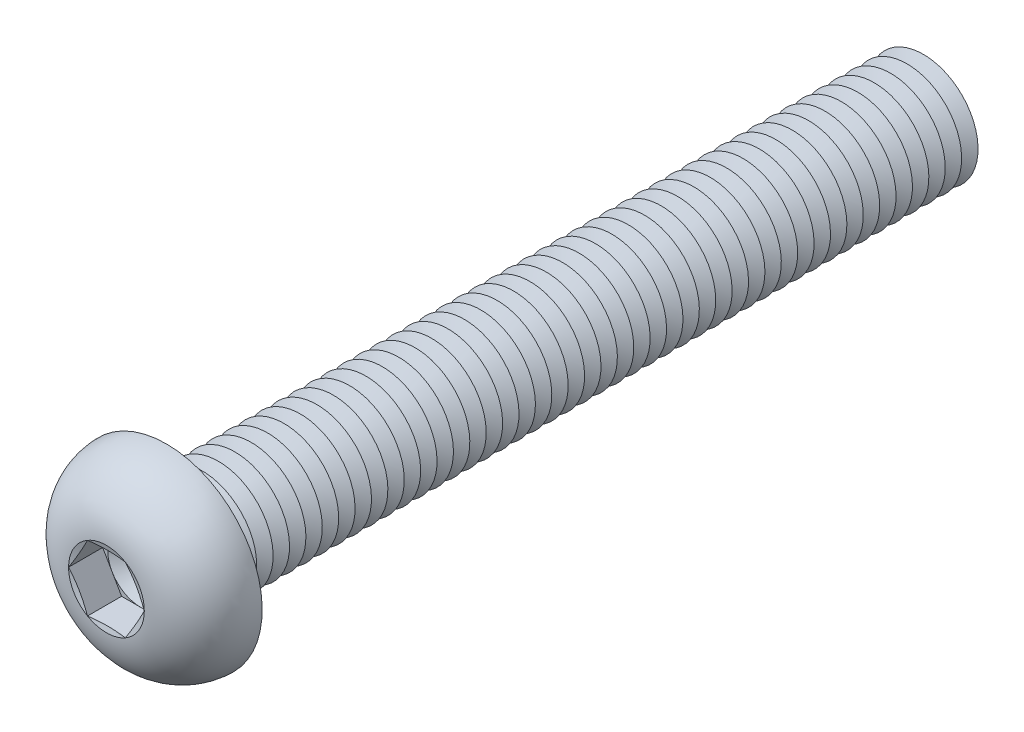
ISO-10303-21;
HEADER;
FILE_DESCRIPTION(('STEP AP214'),'2;1');
FILE_NAME('part.step','',(''),(''),'','','');
FILE_SCHEMA(('AUTOMOTIVE_DESIGN { 1 0 10303 214 1 1 1 1 }'));
ENDSEC;
DATA;
#1=APPLICATION_CONTEXT('core data for automotive mechanical design processes');
#2=APPLICATION_PROTOCOL_DEFINITION('international standard','automotive_design',2000,#1);
#3=PRODUCT_CONTEXT('',#1,'mechanical');
#4=PRODUCT('Part','Part','',(#3));
#5=PRODUCT_RELATED_PRODUCT_CATEGORY('part','',(#4));
#6=PRODUCT_DEFINITION_FORMATION('','',#4);
#7=PRODUCT_DEFINITION_CONTEXT('part definition',#1,'design');
#8=PRODUCT_DEFINITION('design','',#6,#7);
#9=PRODUCT_DEFINITION_SHAPE('','',#8);
#10=(LENGTH_UNIT() NAMED_UNIT(*) SI_UNIT(.MILLI.,.METRE.));
#11=(NAMED_UNIT(*) PLANE_ANGLE_UNIT() SI_UNIT($,.RADIAN.));
#12=(NAMED_UNIT(*) SI_UNIT($,.STERADIAN.) SOLID_ANGLE_UNIT());
#13=UNCERTAINTY_MEASURE_WITH_UNIT(LENGTH_MEASURE(1.E-05),#10,'distance_accuracy_value','');
#14=(GEOMETRIC_REPRESENTATION_CONTEXT(3) GLOBAL_UNCERTAINTY_ASSIGNED_CONTEXT((#13)) GLOBAL_UNIT_ASSIGNED_CONTEXT((#10,
#11,#12)) REPRESENTATION_CONTEXT('',''));
#15=CARTESIAN_POINT('',(0.,0.,0.));
#16=DIRECTION('',(0.,0.,1.));
#17=DIRECTION('',(1.,0.,0.));
#18=AXIS2_PLACEMENT_3D('',#15,#16,#17);
#19=CARTESIAN_POINT('',(0.,0.,2.38));
#20=DIRECTION('',(0.,0.,1.));
#21=DIRECTION('',(1.,0.,0.));
#22=AXIS2_PLACEMENT_3D('',#19,#20,#21);
#23=PLANE('',#22);
#24=CARTESIAN_POINT('',(0.,0.,2.38));
#25=DIRECTION('',(0.,0.,1.));
#26=DIRECTION('',(1.,0.,0.));
#27=AXIS2_PLACEMENT_3D('',#24,#25,#26);
#28=CIRCLE('',#27,2.99999860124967);
#29=CARTESIAN_POINT('',(2.598075,1.49999930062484,2.38));
#30=VERTEX_POINT('',#29);
#31=CARTESIAN_POINT('',(0.,2.99999860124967,2.38));
#32=VERTEX_POINT('',#31);
#33=EDGE_CURVE('E118',#30,#32,#28,.T.);
#34=ORIENTED_EDGE('',*,*,#33,.F.);
#35=DIRECTION('',(-0.500000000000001,0.866025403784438,0.));
#36=VECTOR('',#35,1.);
#37=CARTESIAN_POINT('',(3.4641,0.,2.38));
#38=LINE('',#37,#36);
#39=CARTESIAN_POINT('',(1.73205,2.99999860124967,2.38));
#40=VERTEX_POINT('',#39);
#41=EDGE_CURVE('E125',#30,#40,#38,.T.);
#42=ORIENTED_EDGE('',*,*,#41,.T.);
#43=DIRECTION('',(-1.,0.,0.));
#44=VECTOR('',#43,1.);
#45=CARTESIAN_POINT('',(1.73205,2.99999860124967,2.38));
#46=LINE('',#45,#44);
#47=EDGE_CURVE('E136',#40,#32,#46,.T.);
#48=ORIENTED_EDGE('',*,*,#47,.T.);
#49=EDGE_LOOP('',(#34,#42,#48));
#50=FACE_BOUND('',#49,.T.);
#51=ADVANCED_FACE('F39',(#50),#23,.T.);
#52=CARTESIAN_POINT('',(0.,0.,2.38));
#53=DIRECTION('',(0.,0.,1.));
#54=DIRECTION('',(1.,0.,0.));
#55=AXIS2_PLACEMENT_3D('',#52,#53,#54);
#56=CIRCLE('',#55,2.99999860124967);
#57=CARTESIAN_POINT('',(-2.598075,1.49999930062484,2.38));
#58=VERTEX_POINT('',#57);
#59=EDGE_CURVE('E11',#32,#58,#56,.T.);
#60=ORIENTED_EDGE('',*,*,#59,.F.);
#61=CARTESIAN_POINT('',(-1.73205,2.99999860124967,2.38));
#62=VERTEX_POINT('',#61);
#63=EDGE_CURVE('E131',#32,#62,#46,.T.);
#64=ORIENTED_EDGE('',*,*,#63,.T.);
#65=DIRECTION('',(-0.5,-0.866025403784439,0.));
#66=VECTOR('',#65,1.);
#67=CARTESIAN_POINT('',(-1.73205,2.99999860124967,2.38));
#68=LINE('',#67,#66);
#69=EDGE_CURVE('E134',#62,#58,#68,.T.);
#70=ORIENTED_EDGE('',*,*,#69,.T.);
#71=EDGE_LOOP('',(#60,#64,#70));
#72=FACE_BOUND('',#71,.T.);
#73=ADVANCED_FACE('F130',(#72),#23,.T.);
#74=CARTESIAN_POINT('',(-2.598075,-1.49999930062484,2.38));
#75=VERTEX_POINT('',#74);
#76=EDGE_CURVE('E49',#58,#75,#56,.T.);
#77=ORIENTED_EDGE('',*,*,#76,.F.);
#78=CARTESIAN_POINT('',(-3.4641,0.,2.38));
#79=VERTEX_POINT('',#78);
#80=EDGE_CURVE('E143',#58,#79,#68,.T.);
#81=ORIENTED_EDGE('',*,*,#80,.T.);
#82=DIRECTION('',(0.5,-0.866025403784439,0.));
#83=VECTOR('',#82,1.);
#84=CARTESIAN_POINT('',(-3.4641,0.,2.38));
#85=LINE('',#84,#83);
#86=EDGE_CURVE('E152',#79,#75,#85,.T.);
#87=ORIENTED_EDGE('',*,*,#86,.T.);
#88=EDGE_LOOP('',(#77,#81,#87));
#89=FACE_BOUND('',#88,.T.);
#90=ADVANCED_FACE('F402',(#89),#23,.T.);
#91=CARTESIAN_POINT('',(0.,-2.99999860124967,2.38));
#92=VERTEX_POINT('',#91);
#93=EDGE_CURVE('E387',#75,#92,#56,.T.);
#94=ORIENTED_EDGE('',*,*,#93,.F.);
#95=CARTESIAN_POINT('',(-1.73205,-2.99999860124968,2.38));
#96=VERTEX_POINT('',#95);
#97=EDGE_CURVE('E151',#75,#96,#85,.T.);
#98=ORIENTED_EDGE('',*,*,#97,.T.);
#99=DIRECTION('',(1.,0.,0.));
#100=VECTOR('',#99,1.);
#101=CARTESIAN_POINT('',(-1.73205,-2.99999860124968,2.38));
#102=LINE('',#101,#100);
#103=EDGE_CURVE('E157',#96,#92,#102,.T.);
#104=ORIENTED_EDGE('',*,*,#103,.T.);
#105=EDGE_LOOP('',(#94,#98,#104));
#106=FACE_BOUND('',#105,.T.);
#107=ADVANCED_FACE('F397',(#106),#23,.T.);
#108=CARTESIAN_POINT('',(2.598075,-1.49999930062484,2.38));
#109=VERTEX_POINT('',#108);
#110=EDGE_CURVE('E56',#92,#109,#56,.T.);
#111=ORIENTED_EDGE('',*,*,#110,.F.);
#112=CARTESIAN_POINT('',(1.73205,-2.99999860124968,2.38));
#113=VERTEX_POINT('',#112);
#114=EDGE_CURVE('E156',#92,#113,#102,.T.);
#115=ORIENTED_EDGE('',*,*,#114,.T.);
#116=DIRECTION('',(0.5,0.866025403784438,0.));
#117=VECTOR('',#116,1.);
#118=CARTESIAN_POINT('',(1.73205,-2.99999860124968,2.38));
#119=LINE('',#118,#117);
#120=EDGE_CURVE('E162',#113,#109,#119,.T.);
#121=ORIENTED_EDGE('',*,*,#120,.T.);
#122=EDGE_LOOP('',(#111,#115,#121));
#123=FACE_BOUND('',#122,.T.);
#124=ADVANCED_FACE('F760',(#123),#23,.T.);
#125=CARTESIAN_POINT('',(0.,0.,5.50000000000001));
#126=DIRECTION('',(0.,0.,1.));
#127=DIRECTION('',(0.,-1.,0.));
#128=AXIS2_PLACEMENT_3D('',#125,#126,#127);
#129=CONICAL_SURFACE('',#128,3.4641,1.30899693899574);
#130=CARTESIAN_POINT('',(3.46421547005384,-0.000200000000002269,5.50003094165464));
#131=CARTESIAN_POINT('',(3.39227822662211,0.124398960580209,5.48074619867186));
#132=CARTESIAN_POINT('',(3.32021054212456,0.249223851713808,5.46323875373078));
#133=CARTESIAN_POINT('',(3.17582062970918,0.499314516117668,5.43247971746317));
#134=CARTESIAN_POINT('',(3.10349831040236,0.624580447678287,5.41922985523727));
#135=CARTESIAN_POINT('',(2.95903767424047,0.874793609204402,5.39775958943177));
#136=CARTESIAN_POINT('',(2.88690033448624,0.999739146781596,5.38951357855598));
#137=CARTESIAN_POINT('',(2.74253364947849,1.2497895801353,5.37845651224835));
#138=CARTESIAN_POINT('',(2.67030432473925,1.37489444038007,5.3756444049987));
#139=CARTESIAN_POINT('',(2.52584567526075,1.6251041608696,5.3756444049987));
#140=CARTESIAN_POINT('',(2.45361635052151,1.75020902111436,5.37845651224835));
#141=CARTESIAN_POINT('',(2.30924966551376,2.00025945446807,5.38951357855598));
#142=CARTESIAN_POINT('',(2.23711232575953,2.12520499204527,5.39775958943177));
#143=CARTESIAN_POINT('',(2.09265168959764,2.37541815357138,5.41922985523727));
#144=CARTESIAN_POINT('',(2.02032937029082,2.500684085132,5.43247971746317));
#145=CARTESIAN_POINT('',(1.87593945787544,2.75077474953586,5.46323875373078));
#146=CARTESIAN_POINT('',(1.80387177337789,2.87559964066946,5.48074619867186));
#147=CARTESIAN_POINT('',(1.73193452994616,3.00019860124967,5.50003094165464));
#148=B_SPLINE_CURVE_WITH_KNOTS('',3,(#130,#131,#132,#133,#134,#135,#136,#137,#138,#139,#140,
#141,#142,#143,#144,#145,#146,#147),.UNSPECIFIED.,.F.,.F.,(4,2,2,2,2,2,2,2,4),(0.,
0.435506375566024,0.871189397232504,1.3046235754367,1.7379738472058,2.1713241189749,
2.6047582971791,3.04044131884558,3.4759476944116),.UNSPECIFIED.);
#149=CARTESIAN_POINT('',(3.4641,0.,5.5));
#150=VERTEX_POINT('',#149);
#151=CARTESIAN_POINT('',(1.73204999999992,2.99999860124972,5.50000000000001));
#152=VERTEX_POINT('',#151);
#153=EDGE_CURVE('E229',#150,#152,#148,.T.);
#154=ORIENTED_EDGE('',*,*,#153,.F.);
#155=CARTESIAN_POINT('',(0.,0.,5.50000000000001));
#156=DIRECTION('',(0.,0.,-1.));
#157=DIRECTION('',(0.,1.,0.));
#158=AXIS2_PLACEMENT_3D('',#155,#156,#157);
#159=CIRCLE('',#158,3.4641);
#160=EDGE_CURVE('E308',#152,#150,#159,.T.);
#161=ORIENTED_EDGE('',*,*,#160,.F.);
#162=EDGE_LOOP('',(#154,#161));
#163=FACE_BOUND('',#162,.T.);
#164=ADVANCED_FACE('F418',(#163),#129,.F.);
#165=CARTESIAN_POINT('',(1.73193452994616,-3.00019860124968,5.50003094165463));
#166=CARTESIAN_POINT('',(1.80387177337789,-2.87559964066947,5.48074619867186));
#167=CARTESIAN_POINT('',(1.87593945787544,-2.75077474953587,5.46323875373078));
#168=CARTESIAN_POINT('',(2.02032937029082,-2.50068408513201,5.43247971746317));
#169=CARTESIAN_POINT('',(2.09265168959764,-2.37541815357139,5.41922985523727));
#170=CARTESIAN_POINT('',(2.23711232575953,-2.12520499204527,5.39775958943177));
#171=CARTESIAN_POINT('',(2.30924966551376,-2.00025945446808,5.38951357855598));
#172=CARTESIAN_POINT('',(2.45361635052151,-1.75020902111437,5.37845651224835));
#173=CARTESIAN_POINT('',(2.52584567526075,-1.6251041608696,5.3756444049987));
#174=CARTESIAN_POINT('',(2.67030432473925,-1.37489444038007,5.3756444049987));
#175=CARTESIAN_POINT('',(2.74253364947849,-1.24978958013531,5.37845651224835));
#176=CARTESIAN_POINT('',(2.88690033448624,-0.999739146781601,5.38951357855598));
#177=CARTESIAN_POINT('',(2.95903767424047,-0.874793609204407,5.39775958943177));
#178=CARTESIAN_POINT('',(3.10349831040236,-0.624580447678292,5.41922985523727));
#179=CARTESIAN_POINT('',(3.17582062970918,-0.499314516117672,5.43247971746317));
#180=CARTESIAN_POINT('',(3.32021054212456,-0.249223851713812,5.46323875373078));
#181=CARTESIAN_POINT('',(3.39227822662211,-0.124398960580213,5.48074619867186));
#182=CARTESIAN_POINT('',(3.46421547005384,0.00019999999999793,5.50003094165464));
#183=B_SPLINE_CURVE_WITH_KNOTS('',3,(#165,#166,#167,#168,#169,#170,#171,#172,#173,#174,#175,
#176,#177,#178,#179,#180,#181,#182),.UNSPECIFIED.,.F.,.F.,(4,2,2,2,2,2,2,2,4),(0.,
0.435506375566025,0.871189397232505,1.3046235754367,1.7379738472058,2.1713241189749,
2.6047582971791,3.04044131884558,3.4759476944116),.UNSPECIFIED.);
#184=CARTESIAN_POINT('',(1.73205,-2.99999860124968,5.5));
#185=VERTEX_POINT('',#184);
#186=EDGE_CURVE('E232',#185,#150,#183,.T.);
#187=ORIENTED_EDGE('',*,*,#186,.F.);
#188=EDGE_CURVE('E291',#150,#185,#159,.T.);
#189=ORIENTED_EDGE('',*,*,#188,.F.);
#190=EDGE_LOOP('',(#187,#189));
#191=FACE_BOUND('',#190,.T.);
#192=ADVANCED_FACE('F289',(#191),#129,.F.);
#193=CARTESIAN_POINT('',(-5.2273006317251,-2.99999860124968,6.18672552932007));
#194=CARTESIAN_POINT('',(-5.10075887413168,-2.99999860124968,6.15732018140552));
#195=CARTESIAN_POINT('',(-4.97415993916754,-2.99999860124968,6.12816064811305));
#196=CARTESIAN_POINT('',(-4.72082394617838,-2.99999860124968,6.07043857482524));
#197=CARTESIAN_POINT('',(-4.59408688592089,-2.99999860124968,6.04187604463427));
#198=CARTESIAN_POINT('',(-4.21358997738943,-2.99999860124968,5.95723252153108));
#199=CARTESIAN_POINT('',(-3.95959339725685,-2.99999860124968,5.90220706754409));
#200=CARTESIAN_POINT('',(-3.44835573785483,-2.99999860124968,5.79574115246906));
#201=CARTESIAN_POINT('',(-3.19110656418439,-2.99999860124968,5.74433913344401));
#202=CARTESIAN_POINT('',(-2.67540790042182,-2.99999860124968,5.6477299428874));
#203=CARTESIAN_POINT('',(-2.41695830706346,-2.99999860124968,5.60252331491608));
#204=CARTESIAN_POINT('',(-1.9055512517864,-2.99999860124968,5.52251897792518));
#205=CARTESIAN_POINT('',(-1.65263426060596,-2.99999860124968,5.48747285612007));
#206=CARTESIAN_POINT('',(-1.27220564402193,-2.99999860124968,5.4443960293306));
#207=CARTESIAN_POINT('',(-1.1452320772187,-2.99999860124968,5.43161987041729));
#208=CARTESIAN_POINT('',(-0.890973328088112,-2.99999860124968,5.40972605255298));
#209=CARTESIAN_POINT('',(-0.76368816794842,-2.99999860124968,5.40060814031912));
#210=CARTESIAN_POINT('',(-0.50944206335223,-2.99999860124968,5.38647457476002));
#211=CARTESIAN_POINT('',(-0.382482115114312,-2.99999860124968,5.38144125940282));
#212=CARTESIAN_POINT('',(-0.128463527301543,-2.99999860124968,5.37566637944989));
#213=CARTESIAN_POINT('',(-0.00140488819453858,-2.99999860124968,5.37492479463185));
#214=CARTESIAN_POINT('',(0.252672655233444,-2.99999860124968,5.37777315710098));
#215=CARTESIAN_POINT('',(0.379691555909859,-2.99999860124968,5.38136342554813));
#216=CARTESIAN_POINT('',(0.633540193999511,-2.99999860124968,5.39268816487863));
#217=CARTESIAN_POINT('',(0.760369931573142,-2.99999860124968,5.40042263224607));
#218=CARTESIAN_POINT('',(1.06836981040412,-2.99999860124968,5.42382465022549));
#219=CARTESIAN_POINT('',(1.24938929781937,-2.99999860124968,5.44147485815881));
#220=CARTESIAN_POINT('',(1.61066786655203,-2.99999860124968,5.48312309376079));
#221=CARTESIAN_POINT('',(1.7909269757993,-2.99999860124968,5.50712088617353));
#222=CARTESIAN_POINT('',(2.15127612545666,-2.99999860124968,5.56013471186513));
#223=CARTESIAN_POINT('',(2.33136383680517,-2.99999860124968,5.58916634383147));
#224=CARTESIAN_POINT('',(2.690892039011,-2.99999860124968,5.65100028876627));
#225=CARTESIAN_POINT('',(2.87033249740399,-2.99999860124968,5.68380278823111));
#226=CARTESIAN_POINT('',(3.23235399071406,-2.99999860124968,5.75295369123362));
#227=CARTESIAN_POINT('',(3.4149236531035,-2.99999860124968,5.78936117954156));
#228=CARTESIAN_POINT('',(3.77960351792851,-2.99999860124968,5.86440648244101));
#229=CARTESIAN_POINT('',(3.96171371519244,-2.99999860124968,5.90304432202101));
#230=CARTESIAN_POINT('',(4.32457472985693,-2.99999860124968,5.98179660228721));
#231=CARTESIAN_POINT('',(4.5053275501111,-2.99999860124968,6.02190185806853));
#232=CARTESIAN_POINT('',(4.86652484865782,-2.99999860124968,6.10342152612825));
#233=CARTESIAN_POINT('',(5.04696934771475,-2.99999860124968,6.14483584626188));
#234=CARTESIAN_POINT('',(5.22730063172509,-2.99999860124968,6.18672552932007));
#235=B_SPLINE_CURVE_WITH_KNOTS('',3,(#193,#194,#195,#196,#197,#198,#199,#200,#201,#202,#203,
#204,#205,#206,#207,#208,#209,#210,#211,#212,#213,#214,#215,#216,#217,#218,#219,#220,#221,#222,
#223,#224,#225,#226,#227,#228,#229,#230,#231,#232,#233,#234),.UNSPECIFIED.,.F.,.F.,(4,2,2,2,2,2,
2,2,2,2,2,2,2,2,2,2,2,2,2,2,4),(0.,0.389739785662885,0.779485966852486,1.5591292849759,
2.34608117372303,3.13310206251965,3.8988410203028,4.28164148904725,4.66441544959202,
5.04552531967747,5.42663339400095,5.80776972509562,6.18890573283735,6.73438998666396,
7.27985402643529,7.8270395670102,8.37425218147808,8.93272720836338,9.49120849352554,
10.0466490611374,10.6020506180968),.UNSPECIFIED.);
#236=CARTESIAN_POINT('',(-1.73205,-2.99999860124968,5.5));
#237=VERTEX_POINT('',#236);
#238=EDGE_CURVE('E242',#237,#185,#235,.T.);
#239=ORIENTED_EDGE('',*,*,#238,.F.);
#240=EDGE_CURVE('E296',#185,#237,#159,.T.);
#241=ORIENTED_EDGE('',*,*,#240,.F.);
#242=EDGE_LOOP('',(#239,#241));
#243=FACE_BOUND('',#242,.T.);
#244=ADVANCED_FACE('F297',(#243),#129,.F.);
#245=CARTESIAN_POINT('',(-3.46421547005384,0.000199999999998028,5.50003094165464));
#246=CARTESIAN_POINT('',(-3.39227822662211,-0.124398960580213,5.48074619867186));
#247=CARTESIAN_POINT('',(-3.32021054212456,-0.249223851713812,5.46323875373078));
#248=CARTESIAN_POINT('',(-3.17582062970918,-0.499314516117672,5.43247971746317));
#249=CARTESIAN_POINT('',(-3.10349831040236,-0.624580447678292,5.41922985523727));
#250=CARTESIAN_POINT('',(-2.95903767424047,-0.874793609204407,5.39775958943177));
#251=CARTESIAN_POINT('',(-2.88690033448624,-0.999739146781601,5.38951357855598));
#252=CARTESIAN_POINT('',(-2.74253364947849,-1.24978958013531,5.37845651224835));
#253=CARTESIAN_POINT('',(-2.67030432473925,-1.37489444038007,5.3756444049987));
#254=CARTESIAN_POINT('',(-2.52584567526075,-1.6251041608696,5.3756444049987));
#255=CARTESIAN_POINT('',(-2.45361635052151,-1.75020902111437,5.37845651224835));
#256=CARTESIAN_POINT('',(-2.30924966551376,-2.00025945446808,5.38951357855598));
#257=CARTESIAN_POINT('',(-2.23711232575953,-2.12520499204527,5.39775958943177));
#258=CARTESIAN_POINT('',(-2.09265168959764,-2.37541815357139,5.41922985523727));
#259=CARTESIAN_POINT('',(-2.02032937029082,-2.50068408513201,5.43247971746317));
#260=CARTESIAN_POINT('',(-1.87593945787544,-2.75077474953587,5.46323875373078));
#261=CARTESIAN_POINT('',(-1.80387177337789,-2.87559964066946,5.48074619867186));
#262=CARTESIAN_POINT('',(-1.73193452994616,-3.00019860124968,5.50003094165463));
#263=B_SPLINE_CURVE_WITH_KNOTS('',3,(#245,#246,#247,#248,#249,#250,#251,#252,#253,#254,#255,
#256,#257,#258,#259,#260,#261,#262),.UNSPECIFIED.,.F.,.F.,(4,2,2,2,2,2,2,2,4),(0.,
0.435506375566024,0.871189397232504,1.3046235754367,1.7379738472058,2.1713241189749,
2.6047582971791,3.04044131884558,3.4759476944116),.UNSPECIFIED.);
#264=CARTESIAN_POINT('',(-3.4641,0.,5.5));
#265=VERTEX_POINT('',#264);
#266=EDGE_CURVE('E237',#265,#237,#263,.T.);
#267=ORIENTED_EDGE('',*,*,#266,.F.);
#268=EDGE_CURVE('E302',#237,#265,#159,.T.);
#269=ORIENTED_EDGE('',*,*,#268,.F.);
#270=EDGE_LOOP('',(#267,#269));
#271=FACE_BOUND('',#270,.T.);
#272=ADVANCED_FACE('F409',(#271),#129,.F.);
#273=CARTESIAN_POINT('',(-1.73193452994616,3.00019860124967,5.50003094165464));
#274=CARTESIAN_POINT('',(-1.8038717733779,2.87559964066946,5.48074619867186));
#275=CARTESIAN_POINT('',(-1.87593945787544,2.75077474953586,5.46323875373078));
#276=CARTESIAN_POINT('',(-2.02032937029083,2.500684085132,5.43247971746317));
#277=CARTESIAN_POINT('',(-2.09265168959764,2.37541815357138,5.41922985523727));
#278=CARTESIAN_POINT('',(-2.23711232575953,2.12520499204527,5.39775958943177));
#279=CARTESIAN_POINT('',(-2.30924966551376,2.00025945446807,5.38951357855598));
#280=CARTESIAN_POINT('',(-2.45361635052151,1.75020902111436,5.37845651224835));
#281=CARTESIAN_POINT('',(-2.52584567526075,1.6251041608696,5.3756444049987));
#282=CARTESIAN_POINT('',(-2.67030432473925,1.37489444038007,5.3756444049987));
#283=CARTESIAN_POINT('',(-2.74253364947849,1.2497895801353,5.37845651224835));
#284=CARTESIAN_POINT('',(-2.88690033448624,0.999739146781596,5.38951357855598));
#285=CARTESIAN_POINT('',(-2.95903767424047,0.874793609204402,5.39775958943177));
#286=CARTESIAN_POINT('',(-3.10349831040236,0.624580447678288,5.41922985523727));
#287=CARTESIAN_POINT('',(-3.17582062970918,0.499314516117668,5.43247971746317));
#288=CARTESIAN_POINT('',(-3.32021054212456,0.249223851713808,5.46323875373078));
#289=CARTESIAN_POINT('',(-3.39227822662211,0.124398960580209,5.48074619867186));
#290=CARTESIAN_POINT('',(-3.46421547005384,-0.000200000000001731,5.50003094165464));
#291=B_SPLINE_CURVE_WITH_KNOTS('',3,(#273,#274,#275,#276,#277,#278,#279,#280,#281,#282,#283,
#284,#285,#286,#287,#288,#289,#290),.UNSPECIFIED.,.F.,.F.,(4,2,2,2,2,2,2,2,4),(0.,
0.435506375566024,0.871189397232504,1.3046235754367,1.7379738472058,2.1713241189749,
2.6047582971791,3.04044131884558,3.4759476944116),.UNSPECIFIED.);
#292=CARTESIAN_POINT('',(-1.73205,2.99999860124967,5.5));
#293=VERTEX_POINT('',#292);
#294=EDGE_CURVE('E234',#293,#265,#291,.T.);
#295=ORIENTED_EDGE('',*,*,#294,.F.);
#296=EDGE_CURVE('E320',#265,#293,#159,.T.);
#297=ORIENTED_EDGE('',*,*,#296,.F.);
#298=EDGE_LOOP('',(#295,#297));
#299=FACE_BOUND('',#298,.T.);
#300=ADVANCED_FACE('F412',(#299),#129,.F.);
#301=CARTESIAN_POINT('',(0.,0.,-64.75));
#302=DIRECTION('',(0.,0.,1.));
#303=DIRECTION('',(0.,-1.,0.));
#304=AXIS2_PLACEMENT_3D('',#301,#302,#303);
#305=CONICAL_SURFACE('',#304,4.99999999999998,1.0471975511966);
#306=CARTESIAN_POINT('',(0.,0.,-65.5));
#307=DIRECTION('',(0.,0.,1.));
#308=DIRECTION('',(0.,-1.,0.));
#309=AXIS2_PLACEMENT_3D('',#306,#307,#308);
#310=CIRCLE('',#309,3.70096189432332);
#311=CARTESIAN_POINT('',(0.,-3.70096189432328,-65.5));
#312=VERTEX_POINT('',#311);
#313=EDGE_CURVE('E450',#312,#312,#310,.T.);
#314=ORIENTED_EDGE('',*,*,#313,.T.);
#315=EDGE_LOOP('',(#314));
#316=FACE_BOUND('',#315,.T.);
#317=CARTESIAN_POINT('',(0.,0.,-64.75));
#318=DIRECTION('',(0.,0.,1.));
#319=DIRECTION('',(0.,-1.,0.));
#320=AXIS2_PLACEMENT_3D('',#317,#318,#319);
#321=CIRCLE('',#320,4.99999999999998);
#322=CARTESIAN_POINT('',(0.,-4.99999999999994,-64.75));
#323=VERTEX_POINT('',#322);
#324=EDGE_CURVE('E456',#323,#323,#321,.T.);
#325=ORIENTED_EDGE('',*,*,#324,.F.);
#326=EDGE_LOOP('',(#325));
#327=FACE_BOUND('',#326,.T.);
#328=ADVANCED_FACE('F814',(#316,#327),#305,.T.);
#329=CARTESIAN_POINT('',(0.,0.,-65.5));
#330=DIRECTION('',(0.,0.,-1.));
#331=DIRECTION('',(0.,1.,0.));
#332=AXIS2_PLACEMENT_3D('',#329,#330,#331);
#333=CONICAL_SURFACE('',#332,3.70096189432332,1.0471975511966);
#334=CARTESIAN_POINT('',(0.,0.,-66.25));
#335=DIRECTION('',(0.,0.,1.));
#336=DIRECTION('',(0.,-1.,0.));
#337=AXIS2_PLACEMENT_3D('',#334,#335,#336);
#338=CIRCLE('',#337,4.99999999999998);
#339=CARTESIAN_POINT('',(0.,-4.99999999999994,-66.25));
#340=VERTEX_POINT('',#339);
#341=EDGE_CURVE('E445',#340,#340,#338,.T.);
#342=ORIENTED_EDGE('',*,*,#341,.T.);
#343=EDGE_LOOP('',(#342));
#344=FACE_BOUND('',#343,.T.);
#345=ORIENTED_EDGE('',*,*,#313,.F.);
#346=EDGE_LOOP('',(#345));
#347=FACE_BOUND('',#346,.T.);
#348=ADVANCED_FACE('F1729',(#344,#347),#333,.T.);
#349=CARTESIAN_POINT('',(0.,4.99999999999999,-70.));
#350=DIRECTION('',(0.,0.,-1.));
#351=DIRECTION('',(0.,1.,0.));
#352=AXIS2_PLACEMENT_3D('',#349,#350,#351);
#353=PLANE('',#352);
#354=CARTESIAN_POINT('',(0.,0.,-70.));
#355=DIRECTION('',(0.,0.,1.));
#356=DIRECTION('',(0.,-1.,0.));
#357=AXIS2_PLACEMENT_3D('',#354,#355,#356);
#358=CIRCLE('',#357,3.70096189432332);
#359=CARTESIAN_POINT('',(0.,-3.70096189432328,-70.));
#360=VERTEX_POINT('',#359);
#361=EDGE_CURVE('E327',#360,#360,#358,.T.);
#362=ORIENTED_EDGE('',*,*,#361,.F.);
#363=EDGE_LOOP('',(#362));
#364=FACE_BOUND('',#363,.T.);
#365=ADVANCED_FACE('F1734',(#364),#353,.T.);
#366=CARTESIAN_POINT('',(0.,0.,-69.25));
#367=DIRECTION('',(0.,0.,1.));
#368=DIRECTION('',(0.,-1.,0.));
#369=AXIS2_PLACEMENT_3D('',#366,#367,#368);
#370=CONICAL_SURFACE('',#369,4.99999999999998,1.0471975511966);
#371=ORIENTED_EDGE('',*,*,#361,.T.);
#372=EDGE_LOOP('',(#371));
#373=FACE_BOUND('',#372,.T.);
#374=CARTESIAN_POINT('',(0.,0.,-69.25));
#375=DIRECTION('',(0.,0.,1.));
#376=DIRECTION('',(0.,-1.,0.));
#377=AXIS2_PLACEMENT_3D('',#374,#375,#376);
#378=CIRCLE('',#377,4.99999999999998);
#379=CARTESIAN_POINT('',(0.,-4.99999999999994,-69.25));
#380=VERTEX_POINT('',#379);
#381=EDGE_CURVE('E355',#380,#380,#378,.T.);
#382=ORIENTED_EDGE('',*,*,#381,.F.);
#383=EDGE_LOOP('',(#382));
#384=FACE_BOUND('',#383,.T.);
#385=ADVANCED_FACE('F1722',(#373,#384),#370,.T.);
#386=CARTESIAN_POINT('',(0.,0.,-68.5));
#387=DIRECTION('',(0.,0.,-1.));
#388=DIRECTION('',(0.,1.,0.));
#389=AXIS2_PLACEMENT_3D('',#386,#387,#388);
#390=CONICAL_SURFACE('',#389,3.70096189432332,1.0471975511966);
#391=ORIENTED_EDGE('',*,*,#381,.T.);
#392=EDGE_LOOP('',(#391));
#393=FACE_BOUND('',#392,.T.);
#394=CARTESIAN_POINT('',(0.,0.,-68.5));
#395=DIRECTION('',(0.,0.,1.));
#396=DIRECTION('',(0.,-1.,0.));
#397=AXIS2_PLACEMENT_3D('',#394,#395,#396);
#398=CIRCLE('',#397,3.70096189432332);
#399=CARTESIAN_POINT('',(0.,-3.70096189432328,-68.5));
#400=VERTEX_POINT('',#399);
#401=EDGE_CURVE('E353',#400,#400,#398,.T.);
#402=ORIENTED_EDGE('',*,*,#401,.F.);
#403=EDGE_LOOP('',(#402));
#404=FACE_BOUND('',#403,.T.);
#405=ADVANCED_FACE('F1713',(#393,#404),#390,.T.);
#406=CARTESIAN_POINT('',(0.,0.,-67.75));
#407=DIRECTION('',(0.,0.,1.));
#408=DIRECTION('',(0.,-1.,0.));
#409=AXIS2_PLACEMENT_3D('',#406,#407,#408);
#410=CONICAL_SURFACE('',#409,4.99999999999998,1.0471975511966);
#411=ORIENTED_EDGE('',*,*,#401,.T.);
#412=EDGE_LOOP('',(#411));
#413=FACE_BOUND('',#412,.T.);
#414=CARTESIAN_POINT('',(0.,0.,-67.75));
#415=DIRECTION('',(0.,0.,1.));
#416=DIRECTION('',(0.,-1.,0.));
#417=AXIS2_PLACEMENT_3D('',#414,#415,#416);
#418=CIRCLE('',#417,4.99999999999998);
#419=CARTESIAN_POINT('',(0.,-4.99999999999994,-67.75));
#420=VERTEX_POINT('',#419);
#421=EDGE_CURVE('E356',#420,#420,#418,.T.);
#422=ORIENTED_EDGE('',*,*,#421,.F.);
#423=EDGE_LOOP('',(#422));
#424=FACE_BOUND('',#423,.T.);
#425=ADVANCED_FACE('F1703',(#413,#424),#410,.T.);
#426=CARTESIAN_POINT('',(0.,0.,-67.));
#427=DIRECTION('',(0.,0.,-1.));
#428=DIRECTION('',(0.,1.,0.));
#429=AXIS2_PLACEMENT_3D('',#426,#427,#428);
#430=CONICAL_SURFACE('',#429,3.70096189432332,1.0471975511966);
#431=ORIENTED_EDGE('',*,*,#421,.T.);
#432=EDGE_LOOP('',(#431));
#433=FACE_BOUND('',#432,.T.);
#434=CARTESIAN_POINT('',(0.,0.,-67.));
#435=DIRECTION('',(0.,0.,1.));
#436=DIRECTION('',(0.,-1.,0.));
#437=AXIS2_PLACEMENT_3D('',#434,#435,#436);
#438=CIRCLE('',#437,3.70096189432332);
#439=CARTESIAN_POINT('',(0.,-3.70096189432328,-67.));
#440=VERTEX_POINT('',#439);
#441=EDGE_CURVE('E365',#440,#440,#438,.T.);
#442=ORIENTED_EDGE('',*,*,#441,.F.);
#443=EDGE_LOOP('',(#442));
#444=FACE_BOUND('',#443,.T.);
#445=ADVANCED_FACE('F1694',(#433,#444),#430,.T.);
#446=CARTESIAN_POINT('',(0.,0.,-66.25));
#447=DIRECTION('',(0.,0.,1.));
#448=DIRECTION('',(0.,-1.,0.));
#449=AXIS2_PLACEMENT_3D('',#446,#447,#448);
#450=CONICAL_SURFACE('',#449,4.99999999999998,1.0471975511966);
#451=ORIENTED_EDGE('',*,*,#441,.T.);
#452=EDGE_LOOP('',(#451));
#453=FACE_BOUND('',#452,.T.);
#454=ORIENTED_EDGE('',*,*,#341,.F.);
#455=EDGE_LOOP('',(#454));
#456=FACE_BOUND('',#455,.T.);
#457=ADVANCED_FACE('F1684',(#453,#456),#450,.T.);
#458=CARTESIAN_POINT('',(0.,0.,-63.25));
#459=DIRECTION('',(0.,0.,1.));
#460=DIRECTION('',(0.,-1.,0.));
#461=AXIS2_PLACEMENT_3D('',#458,#459,#460);
#462=CONICAL_SURFACE('',#461,4.99999999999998,1.0471975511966);
#463=CARTESIAN_POINT('',(0.,0.,-64.));
#464=DIRECTION('',(0.,0.,1.));
#465=DIRECTION('',(0.,-1.,0.));
#466=AXIS2_PLACEMENT_3D('',#463,#464,#465);
#467=CIRCLE('',#466,3.70096189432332);
#468=CARTESIAN_POINT('',(0.,-3.70096189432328,-64.));
#469=VERTEX_POINT('',#468);
#470=EDGE_CURVE('E459',#469,#469,#467,.T.);
#471=ORIENTED_EDGE('',*,*,#470,.T.);
#472=EDGE_LOOP('',(#471));
#473=FACE_BOUND('',#472,.T.);
#474=CARTESIAN_POINT('',(0.,0.,-63.25));
#475=DIRECTION('',(0.,0.,1.));
#476=DIRECTION('',(0.,-1.,0.));
#477=AXIS2_PLACEMENT_3D('',#474,#475,#476);
#478=CIRCLE('',#477,4.99999999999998);
#479=CARTESIAN_POINT('',(0.,-4.99999999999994,-63.25));
#480=VERTEX_POINT('',#479);
#481=EDGE_CURVE('E463',#480,#480,#478,.T.);
#482=ORIENTED_EDGE('',*,*,#481,.F.);
#483=EDGE_LOOP('',(#482));
#484=FACE_BOUND('',#483,.T.);
#485=ADVANCED_FACE('F1674',(#473,#484),#462,.T.);
#486=CARTESIAN_POINT('',(0.,0.,-64.));
#487=DIRECTION('',(0.,0.,-1.));
#488=DIRECTION('',(0.,1.,0.));
#489=AXIS2_PLACEMENT_3D('',#486,#487,#488);
#490=CONICAL_SURFACE('',#489,3.70096189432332,1.0471975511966);
#491=ORIENTED_EDGE('',*,*,#324,.T.);
#492=EDGE_LOOP('',(#491));
#493=FACE_BOUND('',#492,.T.);
#494=ORIENTED_EDGE('',*,*,#470,.F.);
#495=EDGE_LOOP('',(#494));
#496=FACE_BOUND('',#495,.T.);
#497=ADVANCED_FACE('F1664',(#493,#496),#490,.T.);
#498=CARTESIAN_POINT('',(0.,0.,-61.75));
#499=DIRECTION('',(0.,0.,1.));
#500=DIRECTION('',(0.,-1.,0.));
#501=AXIS2_PLACEMENT_3D('',#498,#499,#500);
#502=CONICAL_SURFACE('',#501,4.99999999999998,1.0471975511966);
#503=CARTESIAN_POINT('',(0.,0.,-62.5));
#504=DIRECTION('',(0.,0.,1.));
#505=DIRECTION('',(0.,-1.,0.));
#506=AXIS2_PLACEMENT_3D('',#503,#504,#505);
#507=CIRCLE('',#506,3.70096189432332);
#508=CARTESIAN_POINT('',(0.,-3.70096189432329,-62.5));
#509=VERTEX_POINT('',#508);
#510=EDGE_CURVE('E441',#509,#509,#507,.T.);
#511=ORIENTED_EDGE('',*,*,#510,.T.);
#512=EDGE_LOOP('',(#511));
#513=FACE_BOUND('',#512,.T.);
#514=CARTESIAN_POINT('',(0.,0.,-61.75));
#515=DIRECTION('',(0.,0.,1.));
#516=DIRECTION('',(0.,-1.,0.));
#517=AXIS2_PLACEMENT_3D('',#514,#515,#516);
#518=CIRCLE('',#517,4.99999999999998);
#519=CARTESIAN_POINT('',(0.,-4.99999999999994,-61.75));
#520=VERTEX_POINT('',#519);
#521=EDGE_CURVE('E439',#520,#520,#518,.T.);
#522=ORIENTED_EDGE('',*,*,#521,.F.);
#523=EDGE_LOOP('',(#522));
#524=FACE_BOUND('',#523,.T.);
#525=ADVANCED_FACE('F1654',(#513,#524),#502,.T.);
#526=CARTESIAN_POINT('',(0.,0.,-62.5));
#527=DIRECTION('',(0.,0.,-1.));
#528=DIRECTION('',(0.,1.,0.));
#529=AXIS2_PLACEMENT_3D('',#526,#527,#528);
#530=CONICAL_SURFACE('',#529,3.70096189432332,1.0471975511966);
#531=ORIENTED_EDGE('',*,*,#481,.T.);
#532=EDGE_LOOP('',(#531));
#533=FACE_BOUND('',#532,.T.);
#534=ORIENTED_EDGE('',*,*,#510,.F.);
#535=EDGE_LOOP('',(#534));
#536=FACE_BOUND('',#535,.T.);
#537=ADVANCED_FACE('F1644',(#533,#536),#530,.T.);
#538=CARTESIAN_POINT('',(0.,0.,-60.25));
#539=DIRECTION('',(0.,0.,1.));
#540=DIRECTION('',(0.,-1.,0.));
#541=AXIS2_PLACEMENT_3D('',#538,#539,#540);
#542=CONICAL_SURFACE('',#541,4.99999999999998,1.0471975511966);
#543=CARTESIAN_POINT('',(0.,0.,-61.));
#544=DIRECTION('',(0.,0.,1.));
#545=DIRECTION('',(0.,-1.,0.));
#546=AXIS2_PLACEMENT_3D('',#543,#544,#545);
#547=CIRCLE('',#546,3.70096189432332);
#548=CARTESIAN_POINT('',(0.,-3.70096189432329,-61.));
#549=VERTEX_POINT('',#548);
#550=EDGE_CURVE('E442',#549,#549,#547,.T.);
#551=ORIENTED_EDGE('',*,*,#550,.T.);
#552=EDGE_LOOP('',(#551));
#553=FACE_BOUND('',#552,.T.);
#554=CARTESIAN_POINT('',(0.,0.,-60.25));
#555=DIRECTION('',(0.,0.,1.));
#556=DIRECTION('',(0.,-1.,0.));
#557=AXIS2_PLACEMENT_3D('',#554,#555,#556);
#558=CIRCLE('',#557,4.99999999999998);
#559=CARTESIAN_POINT('',(0.,-4.99999999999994,-60.25));
#560=VERTEX_POINT('',#559);
#561=EDGE_CURVE('E472',#560,#560,#558,.T.);
#562=ORIENTED_EDGE('',*,*,#561,.F.);
#563=EDGE_LOOP('',(#562));
#564=FACE_BOUND('',#563,.T.);
#565=ADVANCED_FACE('F1634',(#553,#564),#542,.T.);
#566=CARTESIAN_POINT('',(0.,0.,-61.));
#567=DIRECTION('',(0.,0.,-1.));
#568=DIRECTION('',(0.,1.,0.));
#569=AXIS2_PLACEMENT_3D('',#566,#567,#568);
#570=CONICAL_SURFACE('',#569,3.70096189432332,1.0471975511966);
#571=ORIENTED_EDGE('',*,*,#521,.T.);
#572=EDGE_LOOP('',(#571));
#573=FACE_BOUND('',#572,.T.);
#574=ORIENTED_EDGE('',*,*,#550,.F.);
#575=EDGE_LOOP('',(#574));
#576=FACE_BOUND('',#575,.T.);
#577=ADVANCED_FACE('F1624',(#573,#576),#570,.T.);
#578=CARTESIAN_POINT('',(0.,0.,-58.75));
#579=DIRECTION('',(0.,0.,1.));
#580=DIRECTION('',(0.,-1.,0.));
#581=AXIS2_PLACEMENT_3D('',#578,#579,#580);
#582=CONICAL_SURFACE('',#581,4.99999999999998,1.0471975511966);
#583=CARTESIAN_POINT('',(0.,0.,-59.5));
#584=DIRECTION('',(0.,0.,1.));
#585=DIRECTION('',(0.,-1.,0.));
#586=AXIS2_PLACEMENT_3D('',#583,#584,#585);
#587=CIRCLE('',#586,3.70096189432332);
#588=CARTESIAN_POINT('',(0.,-3.70096189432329,-59.5));
#589=VERTEX_POINT('',#588);
#590=EDGE_CURVE('E476',#589,#589,#587,.T.);
#591=ORIENTED_EDGE('',*,*,#590,.T.);
#592=EDGE_LOOP('',(#591));
#593=FACE_BOUND('',#592,.T.);
#594=CARTESIAN_POINT('',(0.,0.,-58.75));
#595=DIRECTION('',(0.,0.,1.));
#596=DIRECTION('',(0.,-1.,0.));
#597=AXIS2_PLACEMENT_3D('',#594,#595,#596);
#598=CIRCLE('',#597,4.99999999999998);
#599=CARTESIAN_POINT('',(0.,-4.99999999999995,-58.75));
#600=VERTEX_POINT('',#599);
#601=EDGE_CURVE('E480',#600,#600,#598,.T.);
#602=ORIENTED_EDGE('',*,*,#601,.F.);
#603=EDGE_LOOP('',(#602));
#604=FACE_BOUND('',#603,.T.);
#605=ADVANCED_FACE('F1614',(#593,#604),#582,.T.);
#606=CARTESIAN_POINT('',(0.,0.,-59.5));
#607=DIRECTION('',(0.,0.,-1.));
#608=DIRECTION('',(0.,1.,0.));
#609=AXIS2_PLACEMENT_3D('',#606,#607,#608);
#610=CONICAL_SURFACE('',#609,3.70096189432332,1.0471975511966);
#611=ORIENTED_EDGE('',*,*,#561,.T.);
#612=EDGE_LOOP('',(#611));
#613=FACE_BOUND('',#612,.T.);
#614=ORIENTED_EDGE('',*,*,#590,.F.);
#615=EDGE_LOOP('',(#614));
#616=FACE_BOUND('',#615,.T.);
#617=ADVANCED_FACE('F1604',(#613,#616),#610,.T.);
#618=CARTESIAN_POINT('',(0.,0.,-57.25));
#619=DIRECTION('',(0.,0.,1.));
#620=DIRECTION('',(0.,-1.,0.));
#621=AXIS2_PLACEMENT_3D('',#618,#619,#620);
#622=CONICAL_SURFACE('',#621,4.99999999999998,1.0471975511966);
#623=CARTESIAN_POINT('',(0.,0.,-58.));
#624=DIRECTION('',(0.,0.,1.));
#625=DIRECTION('',(0.,-1.,0.));
#626=AXIS2_PLACEMENT_3D('',#623,#624,#625);
#627=CIRCLE('',#626,3.70096189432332);
#628=CARTESIAN_POINT('',(0.,-3.70096189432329,-58.));
#629=VERTEX_POINT('',#628);
#630=EDGE_CURVE('E484',#629,#629,#627,.T.);
#631=ORIENTED_EDGE('',*,*,#630,.T.);
#632=EDGE_LOOP('',(#631));
#633=FACE_BOUND('',#632,.T.);
#634=CARTESIAN_POINT('',(0.,0.,-57.25));
#635=DIRECTION('',(0.,0.,1.));
#636=DIRECTION('',(0.,-1.,0.));
#637=AXIS2_PLACEMENT_3D('',#634,#635,#636);
#638=CIRCLE('',#637,4.99999999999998);
#639=CARTESIAN_POINT('',(0.,-4.99999999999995,-57.25));
#640=VERTEX_POINT('',#639);
#641=EDGE_CURVE('E436',#640,#640,#638,.T.);
#642=ORIENTED_EDGE('',*,*,#641,.F.);
#643=EDGE_LOOP('',(#642));
#644=FACE_BOUND('',#643,.T.);
#645=ADVANCED_FACE('F1594',(#633,#644),#622,.T.);
#646=CARTESIAN_POINT('',(0.,0.,-58.));
#647=DIRECTION('',(0.,0.,-1.));
#648=DIRECTION('',(0.,1.,0.));
#649=AXIS2_PLACEMENT_3D('',#646,#647,#648);
#650=CONICAL_SURFACE('',#649,3.70096189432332,1.0471975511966);
#651=ORIENTED_EDGE('',*,*,#601,.T.);
#652=EDGE_LOOP('',(#651));
#653=FACE_BOUND('',#652,.T.);
#654=ORIENTED_EDGE('',*,*,#630,.F.);
#655=EDGE_LOOP('',(#654));
#656=FACE_BOUND('',#655,.T.);
#657=ADVANCED_FACE('F1584',(#653,#656),#650,.T.);
#658=CARTESIAN_POINT('',(0.,0.,-55.75));
#659=DIRECTION('',(0.,0.,1.));
#660=DIRECTION('',(0.,-1.,0.));
#661=AXIS2_PLACEMENT_3D('',#658,#659,#660);
#662=CONICAL_SURFACE('',#661,4.99999999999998,1.0471975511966);
#663=CARTESIAN_POINT('',(0.,0.,-56.5));
#664=DIRECTION('',(0.,0.,1.));
#665=DIRECTION('',(0.,-1.,0.));
#666=AXIS2_PLACEMENT_3D('',#663,#664,#665);
#667=CIRCLE('',#666,3.70096189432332);
#668=CARTESIAN_POINT('',(0.,-3.70096189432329,-56.5));
#669=VERTEX_POINT('',#668);
#670=EDGE_CURVE('E433',#669,#669,#667,.T.);
#671=ORIENTED_EDGE('',*,*,#670,.T.);
#672=EDGE_LOOP('',(#671));
#673=FACE_BOUND('',#672,.T.);
#674=CARTESIAN_POINT('',(0.,0.,-55.75));
#675=DIRECTION('',(0.,0.,1.));
#676=DIRECTION('',(0.,-1.,0.));
#677=AXIS2_PLACEMENT_3D('',#674,#675,#676);
#678=CIRCLE('',#677,4.99999999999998);
#679=CARTESIAN_POINT('',(0.,-4.99999999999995,-55.75));
#680=VERTEX_POINT('',#679);
#681=EDGE_CURVE('E437',#680,#680,#678,.T.);
#682=ORIENTED_EDGE('',*,*,#681,.F.);
#683=EDGE_LOOP('',(#682));
#684=FACE_BOUND('',#683,.T.);
#685=ADVANCED_FACE('F1574',(#673,#684),#662,.T.);
#686=CARTESIAN_POINT('',(0.,0.,-56.5));
#687=DIRECTION('',(0.,0.,-1.));
#688=DIRECTION('',(0.,1.,0.));
#689=AXIS2_PLACEMENT_3D('',#686,#687,#688);
#690=CONICAL_SURFACE('',#689,3.70096189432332,1.0471975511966);
#691=ORIENTED_EDGE('',*,*,#641,.T.);
#692=EDGE_LOOP('',(#691));
#693=FACE_BOUND('',#692,.T.);
#694=ORIENTED_EDGE('',*,*,#670,.F.);
#695=EDGE_LOOP('',(#694));
#696=FACE_BOUND('',#695,.T.);
#697=ADVANCED_FACE('F1564',(#693,#696),#690,.T.);
#698=CARTESIAN_POINT('',(0.,0.,-54.25));
#699=DIRECTION('',(0.,0.,1.));
#700=DIRECTION('',(0.,-1.,0.));
#701=AXIS2_PLACEMENT_3D('',#698,#699,#700);
#702=CONICAL_SURFACE('',#701,4.99999999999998,1.0471975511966);
#703=CARTESIAN_POINT('',(0.,0.,-55.));
#704=DIRECTION('',(0.,0.,1.));
#705=DIRECTION('',(0.,-1.,0.));
#706=AXIS2_PLACEMENT_3D('',#703,#704,#705);
#707=CIRCLE('',#706,3.70096189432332);
#708=CARTESIAN_POINT('',(0.,-3.70096189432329,-55.));
#709=VERTEX_POINT('',#708);
#710=EDGE_CURVE('E494',#709,#709,#707,.T.);
#711=ORIENTED_EDGE('',*,*,#710,.T.);
#712=EDGE_LOOP('',(#711));
#713=FACE_BOUND('',#712,.T.);
#714=CARTESIAN_POINT('',(0.,0.,-54.25));
#715=DIRECTION('',(0.,0.,1.));
#716=DIRECTION('',(0.,-1.,0.));
#717=AXIS2_PLACEMENT_3D('',#714,#715,#716);
#718=CIRCLE('',#717,4.99999999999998);
#719=CARTESIAN_POINT('',(0.,-4.99999999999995,-54.25));
#720=VERTEX_POINT('',#719);
#721=EDGE_CURVE('E498',#720,#720,#718,.T.);
#722=ORIENTED_EDGE('',*,*,#721,.F.);
#723=EDGE_LOOP('',(#722));
#724=FACE_BOUND('',#723,.T.);
#725=ADVANCED_FACE('F1554',(#713,#724),#702,.T.);
#726=CARTESIAN_POINT('',(0.,0.,-55.));
#727=DIRECTION('',(0.,0.,-1.));
#728=DIRECTION('',(0.,1.,0.));
#729=AXIS2_PLACEMENT_3D('',#726,#727,#728);
#730=CONICAL_SURFACE('',#729,3.70096189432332,1.0471975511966);
#731=ORIENTED_EDGE('',*,*,#681,.T.);
#732=EDGE_LOOP('',(#731));
#733=FACE_BOUND('',#732,.T.);
#734=ORIENTED_EDGE('',*,*,#710,.F.);
#735=EDGE_LOOP('',(#734));
#736=FACE_BOUND('',#735,.T.);
#737=ADVANCED_FACE('F1544',(#733,#736),#730,.T.);
#738=CARTESIAN_POINT('',(0.,0.,-52.75));
#739=DIRECTION('',(0.,0.,1.));
#740=DIRECTION('',(0.,-1.,0.));
#741=AXIS2_PLACEMENT_3D('',#738,#739,#740);
#742=CONICAL_SURFACE('',#741,4.99999999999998,1.0471975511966);
#743=CARTESIAN_POINT('',(0.,0.,-53.5));
#744=DIRECTION('',(0.,0.,1.));
#745=DIRECTION('',(0.,-1.,0.));
#746=AXIS2_PLACEMENT_3D('',#743,#744,#745);
#747=CIRCLE('',#746,3.70096189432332);
#748=CARTESIAN_POINT('',(0.,-3.70096189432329,-53.5));
#749=VERTEX_POINT('',#748);
#750=EDGE_CURVE('E430',#749,#749,#747,.T.);
#751=ORIENTED_EDGE('',*,*,#750,.T.);
#752=EDGE_LOOP('',(#751));
#753=FACE_BOUND('',#752,.T.);
#754=CARTESIAN_POINT('',(0.,0.,-52.75));
#755=DIRECTION('',(0.,0.,1.));
#756=DIRECTION('',(0.,-1.,0.));
#757=AXIS2_PLACEMENT_3D('',#754,#755,#756);
#758=CIRCLE('',#757,4.99999999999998);
#759=CARTESIAN_POINT('',(0.,-4.99999999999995,-52.75));
#760=VERTEX_POINT('',#759);
#761=EDGE_CURVE('E427',#760,#760,#758,.T.);
#762=ORIENTED_EDGE('',*,*,#761,.F.);
#763=EDGE_LOOP('',(#762));
#764=FACE_BOUND('',#763,.T.);
#765=ADVANCED_FACE('F1534',(#753,#764),#742,.T.);
#766=CARTESIAN_POINT('',(0.,0.,-53.5));
#767=DIRECTION('',(0.,0.,-1.));
#768=DIRECTION('',(0.,1.,0.));
#769=AXIS2_PLACEMENT_3D('',#766,#767,#768);
#770=CONICAL_SURFACE('',#769,3.70096189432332,1.0471975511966);
#771=ORIENTED_EDGE('',*,*,#721,.T.);
#772=EDGE_LOOP('',(#771));
#773=FACE_BOUND('',#772,.T.);
#774=ORIENTED_EDGE('',*,*,#750,.F.);
#775=EDGE_LOOP('',(#774));
#776=FACE_BOUND('',#775,.T.);
#777=ADVANCED_FACE('F1524',(#773,#776),#770,.T.);
#778=CARTESIAN_POINT('',(0.,0.,-51.25));
#779=DIRECTION('',(0.,0.,1.));
#780=DIRECTION('',(0.,-1.,0.));
#781=AXIS2_PLACEMENT_3D('',#778,#779,#780);
#782=CONICAL_SURFACE('',#781,4.99999999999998,1.0471975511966);
#783=CARTESIAN_POINT('',(0.,0.,-52.));
#784=DIRECTION('',(0.,0.,1.));
#785=DIRECTION('',(0.,-1.,0.));
#786=AXIS2_PLACEMENT_3D('',#783,#784,#785);
#787=CIRCLE('',#786,3.70096189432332);
#788=CARTESIAN_POINT('',(0.,-3.70096189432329,-52.));
#789=VERTEX_POINT('',#788);
#790=EDGE_CURVE('E431',#789,#789,#787,.T.);
#791=ORIENTED_EDGE('',*,*,#790,.T.);
#792=EDGE_LOOP('',(#791));
#793=FACE_BOUND('',#792,.T.);
#794=CARTESIAN_POINT('',(0.,0.,-51.25));
#795=DIRECTION('',(0.,0.,1.));
#796=DIRECTION('',(0.,-1.,0.));
#797=AXIS2_PLACEMENT_3D('',#794,#795,#796);
#798=CIRCLE('',#797,4.99999999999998);
#799=CARTESIAN_POINT('',(0.,-4.99999999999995,-51.25));
#800=VERTEX_POINT('',#799);
#801=EDGE_CURVE('E508',#800,#800,#798,.T.);
#802=ORIENTED_EDGE('',*,*,#801,.F.);
#803=EDGE_LOOP('',(#802));
#804=FACE_BOUND('',#803,.T.);
#805=ADVANCED_FACE('F1514',(#793,#804),#782,.T.);
#806=CARTESIAN_POINT('',(0.,0.,-52.));
#807=DIRECTION('',(0.,0.,-1.));
#808=DIRECTION('',(0.,1.,0.));
#809=AXIS2_PLACEMENT_3D('',#806,#807,#808);
#810=CONICAL_SURFACE('',#809,3.70096189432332,1.0471975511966);
#811=ORIENTED_EDGE('',*,*,#761,.T.);
#812=EDGE_LOOP('',(#811));
#813=FACE_BOUND('',#812,.T.);
#814=ORIENTED_EDGE('',*,*,#790,.F.);
#815=EDGE_LOOP('',(#814));
#816=FACE_BOUND('',#815,.T.);
#817=ADVANCED_FACE('F1504',(#813,#816),#810,.T.);
#818=CARTESIAN_POINT('',(0.,0.,-49.75));
#819=DIRECTION('',(0.,0.,1.));
#820=DIRECTION('',(0.,-1.,0.));
#821=AXIS2_PLACEMENT_3D('',#818,#819,#820);
#822=CONICAL_SURFACE('',#821,4.99999999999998,1.0471975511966);
#823=CARTESIAN_POINT('',(0.,0.,-50.5));
#824=DIRECTION('',(0.,0.,1.));
#825=DIRECTION('',(0.,-1.,0.));
#826=AXIS2_PLACEMENT_3D('',#823,#824,#825);
#827=CIRCLE('',#826,3.70096189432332);
#828=CARTESIAN_POINT('',(0.,-3.70096189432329,-50.5));
#829=VERTEX_POINT('',#828);
#830=EDGE_CURVE('E512',#829,#829,#827,.T.);
#831=ORIENTED_EDGE('',*,*,#830,.T.);
#832=EDGE_LOOP('',(#831));
#833=FACE_BOUND('',#832,.T.);
#834=CARTESIAN_POINT('',(0.,0.,-49.75));
#835=DIRECTION('',(0.,0.,1.));
#836=DIRECTION('',(0.,-1.,0.));
#837=AXIS2_PLACEMENT_3D('',#834,#835,#836);
#838=CIRCLE('',#837,4.99999999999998);
#839=CARTESIAN_POINT('',(0.,-4.99999999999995,-49.75));
#840=VERTEX_POINT('',#839);
#841=EDGE_CURVE('E516',#840,#840,#838,.T.);
#842=ORIENTED_EDGE('',*,*,#841,.F.);
#843=EDGE_LOOP('',(#842));
#844=FACE_BOUND('',#843,.T.);
#845=ADVANCED_FACE('F1494',(#833,#844),#822,.T.);
#846=CARTESIAN_POINT('',(0.,0.,-50.5));
#847=DIRECTION('',(0.,0.,-1.));
#848=DIRECTION('',(0.,1.,0.));
#849=AXIS2_PLACEMENT_3D('',#846,#847,#848);
#850=CONICAL_SURFACE('',#849,3.70096189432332,1.0471975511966);
#851=ORIENTED_EDGE('',*,*,#801,.T.);
#852=EDGE_LOOP('',(#851));
#853=FACE_BOUND('',#852,.T.);
#854=ORIENTED_EDGE('',*,*,#830,.F.);
#855=EDGE_LOOP('',(#854));
#856=FACE_BOUND('',#855,.T.);
#857=ADVANCED_FACE('F1484',(#853,#856),#850,.T.);
#858=CARTESIAN_POINT('',(0.,0.,-48.25));
#859=DIRECTION('',(0.,0.,1.));
#860=DIRECTION('',(0.,-1.,0.));
#861=AXIS2_PLACEMENT_3D('',#858,#859,#860);
#862=CONICAL_SURFACE('',#861,4.99999999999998,1.0471975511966);
#863=CARTESIAN_POINT('',(0.,0.,-49.));
#864=DIRECTION('',(0.,0.,1.));
#865=DIRECTION('',(0.,-1.,0.));
#866=AXIS2_PLACEMENT_3D('',#863,#864,#865);
#867=CIRCLE('',#866,3.70096189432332);
#868=CARTESIAN_POINT('',(0.,-3.70096189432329,-49.));
#869=VERTEX_POINT('',#868);
#870=EDGE_CURVE('E520',#869,#869,#867,.T.);
#871=ORIENTED_EDGE('',*,*,#870,.T.);
#872=EDGE_LOOP('',(#871));
#873=FACE_BOUND('',#872,.T.);
#874=CARTESIAN_POINT('',(0.,0.,-48.25));
#875=DIRECTION('',(0.,0.,1.));
#876=DIRECTION('',(0.,-1.,0.));
#877=AXIS2_PLACEMENT_3D('',#874,#875,#876);
#878=CIRCLE('',#877,4.99999999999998);
#879=CARTESIAN_POINT('',(0.,-4.99999999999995,-48.25));
#880=VERTEX_POINT('',#879);
#881=EDGE_CURVE('E350',#880,#880,#878,.T.);
#882=ORIENTED_EDGE('',*,*,#881,.F.);
#883=EDGE_LOOP('',(#882));
#884=FACE_BOUND('',#883,.T.);
#885=ADVANCED_FACE('F1474',(#873,#884),#862,.T.);
#886=CARTESIAN_POINT('',(0.,0.,-49.));
#887=DIRECTION('',(0.,0.,-1.));
#888=DIRECTION('',(0.,1.,0.));
#889=AXIS2_PLACEMENT_3D('',#886,#887,#888);
#890=CONICAL_SURFACE('',#889,3.70096189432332,1.0471975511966);
#891=ORIENTED_EDGE('',*,*,#841,.T.);
#892=EDGE_LOOP('',(#891));
#893=FACE_BOUND('',#892,.T.);
#894=ORIENTED_EDGE('',*,*,#870,.F.);
#895=EDGE_LOOP('',(#894));
#896=FACE_BOUND('',#895,.T.);
#897=ADVANCED_FACE('F1464',(#893,#896),#890,.T.);
#898=CARTESIAN_POINT('',(0.,0.,-46.75));
#899=DIRECTION('',(0.,0.,1.));
#900=DIRECTION('',(0.,-1.,0.));
#901=AXIS2_PLACEMENT_3D('',#898,#899,#900);
#902=CONICAL_SURFACE('',#901,4.99999999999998,1.0471975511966);
#903=CARTESIAN_POINT('',(0.,0.,-47.5));
#904=DIRECTION('',(0.,0.,1.));
#905=DIRECTION('',(0.,-1.,0.));
#906=AXIS2_PLACEMENT_3D('',#903,#904,#905);
#907=CIRCLE('',#906,3.70096189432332);
#908=CARTESIAN_POINT('',(0.,-3.70096189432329,-47.5));
#909=VERTEX_POINT('',#908);
#910=EDGE_CURVE('E348',#909,#909,#907,.T.);
#911=ORIENTED_EDGE('',*,*,#910,.T.);
#912=EDGE_LOOP('',(#911));
#913=FACE_BOUND('',#912,.T.);
#914=CARTESIAN_POINT('',(0.,0.,-46.75));
#915=DIRECTION('',(0.,0.,1.));
#916=DIRECTION('',(0.,-1.,0.));
#917=AXIS2_PLACEMENT_3D('',#914,#915,#916);
#918=CIRCLE('',#917,4.99999999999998);
#919=CARTESIAN_POINT('',(0.,-4.99999999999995,-46.75));
#920=VERTEX_POINT('',#919);
#921=EDGE_CURVE('E351',#920,#920,#918,.T.);
#922=ORIENTED_EDGE('',*,*,#921,.F.);
#923=EDGE_LOOP('',(#922));
#924=FACE_BOUND('',#923,.T.);
#925=ADVANCED_FACE('F1454',(#913,#924),#902,.T.);
#926=CARTESIAN_POINT('',(0.,0.,-47.5));
#927=DIRECTION('',(0.,0.,-1.));
#928=DIRECTION('',(0.,1.,0.));
#929=AXIS2_PLACEMENT_3D('',#926,#927,#928);
#930=CONICAL_SURFACE('',#929,3.70096189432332,1.0471975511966);
#931=ORIENTED_EDGE('',*,*,#881,.T.);
#932=EDGE_LOOP('',(#931));
#933=FACE_BOUND('',#932,.T.);
#934=ORIENTED_EDGE('',*,*,#910,.F.);
#935=EDGE_LOOP('',(#934));
#936=FACE_BOUND('',#935,.T.);
#937=ADVANCED_FACE('F1444',(#933,#936),#930,.T.);
#938=CARTESIAN_POINT('',(0.,0.,-45.25));
#939=DIRECTION('',(0.,0.,1.));
#940=DIRECTION('',(0.,-1.,0.));
#941=AXIS2_PLACEMENT_3D('',#938,#939,#940);
#942=CONICAL_SURFACE('',#941,4.99999999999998,1.0471975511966);
#943=CARTESIAN_POINT('',(0.,0.,-46.));
#944=DIRECTION('',(0.,0.,1.));
#945=DIRECTION('',(0.,-1.,0.));
#946=AXIS2_PLACEMENT_3D('',#943,#944,#945);
#947=CIRCLE('',#946,3.70096189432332);
#948=CARTESIAN_POINT('',(0.,-3.70096189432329,-46.));
#949=VERTEX_POINT('',#948);
#950=EDGE_CURVE('E345',#949,#949,#947,.T.);
#951=ORIENTED_EDGE('',*,*,#950,.T.);
#952=EDGE_LOOP('',(#951));
#953=FACE_BOUND('',#952,.T.);
#954=CARTESIAN_POINT('',(0.,0.,-45.25));
#955=DIRECTION('',(0.,0.,1.));
#956=DIRECTION('',(0.,-1.,0.));
#957=AXIS2_PLACEMENT_3D('',#954,#955,#956);
#958=CIRCLE('',#957,4.99999999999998);
#959=CARTESIAN_POINT('',(0.,-4.99999999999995,-45.25));
#960=VERTEX_POINT('',#959);
#961=EDGE_CURVE('E342',#960,#960,#958,.T.);
#962=ORIENTED_EDGE('',*,*,#961,.F.);
#963=EDGE_LOOP('',(#962));
#964=FACE_BOUND('',#963,.T.);
#965=ADVANCED_FACE('F1434',(#953,#964),#942,.T.);
#966=CARTESIAN_POINT('',(0.,0.,-46.));
#967=DIRECTION('',(0.,0.,-1.));
#968=DIRECTION('',(0.,1.,0.));
#969=AXIS2_PLACEMENT_3D('',#966,#967,#968);
#970=CONICAL_SURFACE('',#969,3.70096189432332,1.0471975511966);
#971=ORIENTED_EDGE('',*,*,#921,.T.);
#972=EDGE_LOOP('',(#971));
#973=FACE_BOUND('',#972,.T.);
#974=ORIENTED_EDGE('',*,*,#950,.F.);
#975=EDGE_LOOP('',(#974));
#976=FACE_BOUND('',#975,.T.);
#977=ADVANCED_FACE('F1424',(#973,#976),#970,.T.);
#978=CARTESIAN_POINT('',(0.,0.,-43.75));
#979=DIRECTION('',(0.,0.,1.));
#980=DIRECTION('',(0.,-1.,0.));
#981=AXIS2_PLACEMENT_3D('',#978,#979,#980);
#982=CONICAL_SURFACE('',#981,4.99999999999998,1.0471975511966);
#983=CARTESIAN_POINT('',(0.,0.,-44.5));
#984=DIRECTION('',(0.,0.,1.));
#985=DIRECTION('',(0.,-1.,0.));
#986=AXIS2_PLACEMENT_3D('',#983,#984,#985);
#987=CIRCLE('',#986,3.70096189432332);
#988=CARTESIAN_POINT('',(0.,-3.70096189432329,-44.5));
#989=VERTEX_POINT('',#988);
#990=EDGE_CURVE('E346',#989,#989,#987,.T.);
#991=ORIENTED_EDGE('',*,*,#990,.T.);
#992=EDGE_LOOP('',(#991));
#993=FACE_BOUND('',#992,.T.);
#994=CARTESIAN_POINT('',(0.,0.,-43.75));
#995=DIRECTION('',(0.,0.,1.));
#996=DIRECTION('',(0.,-1.,0.));
#997=AXIS2_PLACEMENT_3D('',#994,#995,#996);
#998=CIRCLE('',#997,4.99999999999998);
#999=CARTESIAN_POINT('',(0.,-4.99999999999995,-43.75));
#1000=VERTEX_POINT('',#999);
#1001=EDGE_CURVE('E536',#1000,#1000,#998,.T.);
#1002=ORIENTED_EDGE('',*,*,#1001,.F.);
#1003=EDGE_LOOP('',(#1002));
#1004=FACE_BOUND('',#1003,.T.);
#1005=ADVANCED_FACE('F1414',(#993,#1004),#982,.T.);
#1006=CARTESIAN_POINT('',(0.,0.,-44.5));
#1007=DIRECTION('',(0.,0.,-1.));
#1008=DIRECTION('',(0.,1.,0.));
#1009=AXIS2_PLACEMENT_3D('',#1006,#1007,#1008);
#1010=CONICAL_SURFACE('',#1009,3.70096189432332,1.0471975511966);
#1011=ORIENTED_EDGE('',*,*,#961,.T.);
#1012=EDGE_LOOP('',(#1011));
#1013=FACE_BOUND('',#1012,.T.);
#1014=ORIENTED_EDGE('',*,*,#990,.F.);
#1015=EDGE_LOOP('',(#1014));
#1016=FACE_BOUND('',#1015,.T.);
#1017=ADVANCED_FACE('F1404',(#1013,#1016),#1010,.T.);
#1018=CARTESIAN_POINT('',(0.,0.,-42.25));
#1019=DIRECTION('',(0.,0.,1.));
#1020=DIRECTION('',(0.,-1.,0.));
#1021=AXIS2_PLACEMENT_3D('',#1018,#1019,#1020);
#1022=CONICAL_SURFACE('',#1021,4.99999999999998,1.0471975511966);
#1023=CARTESIAN_POINT('',(0.,0.,-43.));
#1024=DIRECTION('',(0.,0.,1.));
#1025=DIRECTION('',(0.,-1.,0.));
#1026=AXIS2_PLACEMENT_3D('',#1023,#1024,#1025);
#1027=CIRCLE('',#1026,3.70096189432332);
#1028=CARTESIAN_POINT('',(0.,-3.70096189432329,-43.));
#1029=VERTEX_POINT('',#1028);
#1030=EDGE_CURVE('E540',#1029,#1029,#1027,.T.);
#1031=ORIENTED_EDGE('',*,*,#1030,.T.);
#1032=EDGE_LOOP('',(#1031));
#1033=FACE_BOUND('',#1032,.T.);
#1034=CARTESIAN_POINT('',(0.,0.,-42.25));
#1035=DIRECTION('',(0.,0.,1.));
#1036=DIRECTION('',(0.,-1.,0.));
#1037=AXIS2_PLACEMENT_3D('',#1034,#1035,#1036);
#1038=CIRCLE('',#1037,4.99999999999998);
#1039=CARTESIAN_POINT('',(0.,-4.99999999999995,-42.25));
#1040=VERTEX_POINT('',#1039);
#1041=EDGE_CURVE('E544',#1040,#1040,#1038,.T.);
#1042=ORIENTED_EDGE('',*,*,#1041,.F.);
#1043=EDGE_LOOP('',(#1042));
#1044=FACE_BOUND('',#1043,.T.);
#1045=ADVANCED_FACE('F1394',(#1033,#1044),#1022,.T.);
#1046=CARTESIAN_POINT('',(0.,0.,-43.));
#1047=DIRECTION('',(0.,0.,-1.));
#1048=DIRECTION('',(0.,1.,0.));
#1049=AXIS2_PLACEMENT_3D('',#1046,#1047,#1048);
#1050=CONICAL_SURFACE('',#1049,3.70096189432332,1.0471975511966);
#1051=ORIENTED_EDGE('',*,*,#1001,.T.);
#1052=EDGE_LOOP('',(#1051));
#1053=FACE_BOUND('',#1052,.T.);
#1054=ORIENTED_EDGE('',*,*,#1030,.F.);
#1055=EDGE_LOOP('',(#1054));
#1056=FACE_BOUND('',#1055,.T.);
#1057=ADVANCED_FACE('F1384',(#1053,#1056),#1050,.T.);
#1058=CARTESIAN_POINT('',(0.,0.,-40.75));
#1059=DIRECTION('',(0.,0.,1.));
#1060=DIRECTION('',(0.,-1.,0.));
#1061=AXIS2_PLACEMENT_3D('',#1058,#1059,#1060);
#1062=CONICAL_SURFACE('',#1061,4.99999999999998,1.0471975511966);
#1063=CARTESIAN_POINT('',(0.,0.,-41.5));
#1064=DIRECTION('',(0.,0.,1.));
#1065=DIRECTION('',(0.,-1.,0.));
#1066=AXIS2_PLACEMENT_3D('',#1063,#1064,#1065);
#1067=CIRCLE('',#1066,3.70096189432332);
#1068=CARTESIAN_POINT('',(0.,-3.7009618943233,-41.5));
#1069=VERTEX_POINT('',#1068);
#1070=EDGE_CURVE('E548',#1069,#1069,#1067,.T.);
#1071=ORIENTED_EDGE('',*,*,#1070,.T.);
#1072=EDGE_LOOP('',(#1071));
#1073=FACE_BOUND('',#1072,.T.);
#1074=CARTESIAN_POINT('',(0.,0.,-40.75));
#1075=DIRECTION('',(0.,0.,1.));
#1076=DIRECTION('',(0.,-1.,0.));
#1077=AXIS2_PLACEMENT_3D('',#1074,#1075,#1076);
#1078=CIRCLE('',#1077,4.99999999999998);
#1079=CARTESIAN_POINT('',(0.,-4.99999999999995,-40.75));
#1080=VERTEX_POINT('',#1079);
#1081=EDGE_CURVE('E552',#1080,#1080,#1078,.T.);
#1082=ORIENTED_EDGE('',*,*,#1081,.F.);
#1083=EDGE_LOOP('',(#1082));
#1084=FACE_BOUND('',#1083,.T.);
#1085=ADVANCED_FACE('F1374',(#1073,#1084),#1062,.T.);
#1086=CARTESIAN_POINT('',(0.,0.,-41.5));
#1087=DIRECTION('',(0.,0.,-1.));
#1088=DIRECTION('',(0.,1.,0.));
#1089=AXIS2_PLACEMENT_3D('',#1086,#1087,#1088);
#1090=CONICAL_SURFACE('',#1089,3.70096189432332,1.0471975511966);
#1091=ORIENTED_EDGE('',*,*,#1041,.T.);
#1092=EDGE_LOOP('',(#1091));
#1093=FACE_BOUND('',#1092,.T.);
#1094=ORIENTED_EDGE('',*,*,#1070,.F.);
#1095=EDGE_LOOP('',(#1094));
#1096=FACE_BOUND('',#1095,.T.);
#1097=ADVANCED_FACE('F1364',(#1093,#1096),#1090,.T.);
#1098=CARTESIAN_POINT('',(0.,0.,-39.25));
#1099=DIRECTION('',(0.,0.,1.));
#1100=DIRECTION('',(0.,-1.,0.));
#1101=AXIS2_PLACEMENT_3D('',#1098,#1099,#1100);
#1102=CONICAL_SURFACE('',#1101,4.99999999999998,1.0471975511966);
#1103=CARTESIAN_POINT('',(0.,0.,-40.));
#1104=DIRECTION('',(0.,0.,1.));
#1105=DIRECTION('',(0.,-1.,0.));
#1106=AXIS2_PLACEMENT_3D('',#1103,#1104,#1105);
#1107=CIRCLE('',#1106,3.70096189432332);
#1108=CARTESIAN_POINT('',(0.,-3.7009618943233,-40.));
#1109=VERTEX_POINT('',#1108);
#1110=EDGE_CURVE('E556',#1109,#1109,#1107,.T.);
#1111=ORIENTED_EDGE('',*,*,#1110,.T.);
#1112=EDGE_LOOP('',(#1111));
#1113=FACE_BOUND('',#1112,.T.);
#1114=CARTESIAN_POINT('',(0.,0.,-39.25));
#1115=DIRECTION('',(0.,0.,1.));
#1116=DIRECTION('',(0.,-1.,0.));
#1117=AXIS2_PLACEMENT_3D('',#1114,#1115,#1116);
#1118=CIRCLE('',#1117,4.99999999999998);
#1119=CARTESIAN_POINT('',(0.,-4.99999999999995,-39.25));
#1120=VERTEX_POINT('',#1119);
#1121=EDGE_CURVE('E560',#1120,#1120,#1118,.T.);
#1122=ORIENTED_EDGE('',*,*,#1121,.F.);
#1123=EDGE_LOOP('',(#1122));
#1124=FACE_BOUND('',#1123,.T.);
#1125=ADVANCED_FACE('F1354',(#1113,#1124),#1102,.T.);
#1126=CARTESIAN_POINT('',(0.,0.,-40.));
#1127=DIRECTION('',(0.,0.,-1.));
#1128=DIRECTION('',(0.,1.,0.));
#1129=AXIS2_PLACEMENT_3D('',#1126,#1127,#1128);
#1130=CONICAL_SURFACE('',#1129,3.70096189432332,1.0471975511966);
#1131=ORIENTED_EDGE('',*,*,#1081,.T.);
#1132=EDGE_LOOP('',(#1131));
#1133=FACE_BOUND('',#1132,.T.);
#1134=ORIENTED_EDGE('',*,*,#1110,.F.);
#1135=EDGE_LOOP('',(#1134));
#1136=FACE_BOUND('',#1135,.T.);
#1137=ADVANCED_FACE('F1344',(#1133,#1136),#1130,.T.);
#1138=CARTESIAN_POINT('',(0.,0.,-37.75));
#1139=DIRECTION('',(0.,0.,1.));
#1140=DIRECTION('',(0.,-1.,0.));
#1141=AXIS2_PLACEMENT_3D('',#1138,#1139,#1140);
#1142=CONICAL_SURFACE('',#1141,4.99999999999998,1.0471975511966);
#1143=CARTESIAN_POINT('',(0.,0.,-38.5));
#1144=DIRECTION('',(0.,0.,1.));
#1145=DIRECTION('',(0.,-1.,0.));
#1146=AXIS2_PLACEMENT_3D('',#1143,#1144,#1145);
#1147=CIRCLE('',#1146,3.70096189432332);
#1148=CARTESIAN_POINT('',(0.,-3.7009618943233,-38.5));
#1149=VERTEX_POINT('',#1148);
#1150=EDGE_CURVE('E564',#1149,#1149,#1147,.T.);
#1151=ORIENTED_EDGE('',*,*,#1150,.T.);
#1152=EDGE_LOOP('',(#1151));
#1153=FACE_BOUND('',#1152,.T.);
#1154=CARTESIAN_POINT('',(0.,0.,-37.75));
#1155=DIRECTION('',(0.,0.,1.));
#1156=DIRECTION('',(0.,-1.,0.));
#1157=AXIS2_PLACEMENT_3D('',#1154,#1155,#1156);
#1158=CIRCLE('',#1157,4.99999999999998);
#1159=CARTESIAN_POINT('',(0.,-4.99999999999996,-37.75));
#1160=VERTEX_POINT('',#1159);
#1161=EDGE_CURVE('E568',#1160,#1160,#1158,.T.);
#1162=ORIENTED_EDGE('',*,*,#1161,.F.);
#1163=EDGE_LOOP('',(#1162));
#1164=FACE_BOUND('',#1163,.T.);
#1165=ADVANCED_FACE('F1334',(#1153,#1164),#1142,.T.);
#1166=CARTESIAN_POINT('',(0.,0.,-38.5));
#1167=DIRECTION('',(0.,0.,-1.));
#1168=DIRECTION('',(0.,1.,0.));
#1169=AXIS2_PLACEMENT_3D('',#1166,#1167,#1168);
#1170=CONICAL_SURFACE('',#1169,3.70096189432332,1.0471975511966);
#1171=ORIENTED_EDGE('',*,*,#1121,.T.);
#1172=EDGE_LOOP('',(#1171));
#1173=FACE_BOUND('',#1172,.T.);
#1174=ORIENTED_EDGE('',*,*,#1150,.F.);
#1175=EDGE_LOOP('',(#1174));
#1176=FACE_BOUND('',#1175,.T.);
#1177=ADVANCED_FACE('F1324',(#1173,#1176),#1170,.T.);
#1178=CARTESIAN_POINT('',(0.,0.,-36.25));
#1179=DIRECTION('',(0.,0.,1.));
#1180=DIRECTION('',(0.,-1.,0.));
#1181=AXIS2_PLACEMENT_3D('',#1178,#1179,#1180);
#1182=CONICAL_SURFACE('',#1181,4.99999999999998,1.0471975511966);
#1183=CARTESIAN_POINT('',(0.,0.,-37.));
#1184=DIRECTION('',(0.,0.,1.));
#1185=DIRECTION('',(0.,-1.,0.));
#1186=AXIS2_PLACEMENT_3D('',#1183,#1184,#1185);
#1187=CIRCLE('',#1186,3.70096189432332);
#1188=CARTESIAN_POINT('',(0.,-3.7009618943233,-37.));
#1189=VERTEX_POINT('',#1188);
#1190=EDGE_CURVE('E572',#1189,#1189,#1187,.T.);
#1191=ORIENTED_EDGE('',*,*,#1190,.T.);
#1192=EDGE_LOOP('',(#1191));
#1193=FACE_BOUND('',#1192,.T.);
#1194=CARTESIAN_POINT('',(0.,0.,-36.25));
#1195=DIRECTION('',(0.,0.,1.));
#1196=DIRECTION('',(0.,-1.,0.));
#1197=AXIS2_PLACEMENT_3D('',#1194,#1195,#1196);
#1198=CIRCLE('',#1197,4.99999999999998);
#1199=CARTESIAN_POINT('',(0.,-4.99999999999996,-36.25));
#1200=VERTEX_POINT('',#1199);
#1201=EDGE_CURVE('E576',#1200,#1200,#1198,.T.);
#1202=ORIENTED_EDGE('',*,*,#1201,.F.);
#1203=EDGE_LOOP('',(#1202));
#1204=FACE_BOUND('',#1203,.T.);
#1205=ADVANCED_FACE('F1314',(#1193,#1204),#1182,.T.);
#1206=CARTESIAN_POINT('',(0.,0.,-37.));
#1207=DIRECTION('',(0.,0.,-1.));
#1208=DIRECTION('',(0.,1.,0.));
#1209=AXIS2_PLACEMENT_3D('',#1206,#1207,#1208);
#1210=CONICAL_SURFACE('',#1209,3.70096189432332,1.0471975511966);
#1211=ORIENTED_EDGE('',*,*,#1161,.T.);
#1212=EDGE_LOOP('',(#1211));
#1213=FACE_BOUND('',#1212,.T.);
#1214=ORIENTED_EDGE('',*,*,#1190,.F.);
#1215=EDGE_LOOP('',(#1214));
#1216=FACE_BOUND('',#1215,.T.);
#1217=ADVANCED_FACE('F1304',(#1213,#1216),#1210,.T.);
#1218=CARTESIAN_POINT('',(0.,0.,-34.75));
#1219=DIRECTION('',(0.,0.,1.));
#1220=DIRECTION('',(0.,-1.,0.));
#1221=AXIS2_PLACEMENT_3D('',#1218,#1219,#1220);
#1222=CONICAL_SURFACE('',#1221,4.99999999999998,1.0471975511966);
#1223=CARTESIAN_POINT('',(0.,0.,-35.5));
#1224=DIRECTION('',(0.,0.,1.));
#1225=DIRECTION('',(0.,-1.,0.));
#1226=AXIS2_PLACEMENT_3D('',#1223,#1224,#1225);
#1227=CIRCLE('',#1226,3.70096189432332);
#1228=CARTESIAN_POINT('',(0.,-3.7009618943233,-35.5));
#1229=VERTEX_POINT('',#1228);
#1230=EDGE_CURVE('E580',#1229,#1229,#1227,.T.);
#1231=ORIENTED_EDGE('',*,*,#1230,.T.);
#1232=EDGE_LOOP('',(#1231));
#1233=FACE_BOUND('',#1232,.T.);
#1234=CARTESIAN_POINT('',(0.,0.,-34.75));
#1235=DIRECTION('',(0.,0.,1.));
#1236=DIRECTION('',(0.,-1.,0.));
#1237=AXIS2_PLACEMENT_3D('',#1234,#1235,#1236);
#1238=CIRCLE('',#1237,4.99999999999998);
#1239=CARTESIAN_POINT('',(0.,-4.99999999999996,-34.75));
#1240=VERTEX_POINT('',#1239);
#1241=EDGE_CURVE('E584',#1240,#1240,#1238,.T.);
#1242=ORIENTED_EDGE('',*,*,#1241,.F.);
#1243=EDGE_LOOP('',(#1242));
#1244=FACE_BOUND('',#1243,.T.);
#1245=ADVANCED_FACE('F1294',(#1233,#1244),#1222,.T.);
#1246=CARTESIAN_POINT('',(0.,0.,-35.5));
#1247=DIRECTION('',(0.,0.,-1.));
#1248=DIRECTION('',(0.,1.,0.));
#1249=AXIS2_PLACEMENT_3D('',#1246,#1247,#1248);
#1250=CONICAL_SURFACE('',#1249,3.70096189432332,1.0471975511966);
#1251=ORIENTED_EDGE('',*,*,#1201,.T.);
#1252=EDGE_LOOP('',(#1251));
#1253=FACE_BOUND('',#1252,.T.);
#1254=ORIENTED_EDGE('',*,*,#1230,.F.);
#1255=EDGE_LOOP('',(#1254));
#1256=FACE_BOUND('',#1255,.T.);
#1257=ADVANCED_FACE('F1284',(#1253,#1256),#1250,.T.);
#1258=CARTESIAN_POINT('',(0.,0.,-33.25));
#1259=DIRECTION('',(0.,0.,1.));
#1260=DIRECTION('',(0.,-1.,0.));
#1261=AXIS2_PLACEMENT_3D('',#1258,#1259,#1260);
#1262=CONICAL_SURFACE('',#1261,4.99999999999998,1.0471975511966);
#1263=CARTESIAN_POINT('',(0.,0.,-34.));
#1264=DIRECTION('',(0.,0.,1.));
#1265=DIRECTION('',(0.,-1.,0.));
#1266=AXIS2_PLACEMENT_3D('',#1263,#1264,#1265);
#1267=CIRCLE('',#1266,3.70096189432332);
#1268=CARTESIAN_POINT('',(0.,-3.7009618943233,-34.));
#1269=VERTEX_POINT('',#1268);
#1270=EDGE_CURVE('E588',#1269,#1269,#1267,.T.);
#1271=ORIENTED_EDGE('',*,*,#1270,.T.);
#1272=EDGE_LOOP('',(#1271));
#1273=FACE_BOUND('',#1272,.T.);
#1274=CARTESIAN_POINT('',(0.,0.,-33.25));
#1275=DIRECTION('',(0.,0.,1.));
#1276=DIRECTION('',(0.,-1.,0.));
#1277=AXIS2_PLACEMENT_3D('',#1274,#1275,#1276);
#1278=CIRCLE('',#1277,4.99999999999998);
#1279=CARTESIAN_POINT('',(0.,-4.99999999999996,-33.25));
#1280=VERTEX_POINT('',#1279);
#1281=EDGE_CURVE('E592',#1280,#1280,#1278,.T.);
#1282=ORIENTED_EDGE('',*,*,#1281,.F.);
#1283=EDGE_LOOP('',(#1282));
#1284=FACE_BOUND('',#1283,.T.);
#1285=ADVANCED_FACE('F1274',(#1273,#1284),#1262,.T.);
#1286=CARTESIAN_POINT('',(0.,0.,-34.));
#1287=DIRECTION('',(0.,0.,-1.));
#1288=DIRECTION('',(0.,1.,0.));
#1289=AXIS2_PLACEMENT_3D('',#1286,#1287,#1288);
#1290=CONICAL_SURFACE('',#1289,3.70096189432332,1.0471975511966);
#1291=ORIENTED_EDGE('',*,*,#1241,.T.);
#1292=EDGE_LOOP('',(#1291));
#1293=FACE_BOUND('',#1292,.T.);
#1294=ORIENTED_EDGE('',*,*,#1270,.F.);
#1295=EDGE_LOOP('',(#1294));
#1296=FACE_BOUND('',#1295,.T.);
#1297=ADVANCED_FACE('F1264',(#1293,#1296),#1290,.T.);
#1298=CARTESIAN_POINT('',(0.,0.,-31.75));
#1299=DIRECTION('',(0.,0.,1.));
#1300=DIRECTION('',(0.,-1.,0.));
#1301=AXIS2_PLACEMENT_3D('',#1298,#1299,#1300);
#1302=CONICAL_SURFACE('',#1301,4.99999999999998,1.0471975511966);
#1303=CARTESIAN_POINT('',(0.,0.,-32.5));
#1304=DIRECTION('',(0.,0.,1.));
#1305=DIRECTION('',(0.,-1.,0.));
#1306=AXIS2_PLACEMENT_3D('',#1303,#1304,#1305);
#1307=CIRCLE('',#1306,3.70096189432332);
#1308=CARTESIAN_POINT('',(0.,-3.7009618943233,-32.5));
#1309=VERTEX_POINT('',#1308);
#1310=EDGE_CURVE('E339',#1309,#1309,#1307,.T.);
#1311=ORIENTED_EDGE('',*,*,#1310,.T.);
#1312=EDGE_LOOP('',(#1311));
#1313=FACE_BOUND('',#1312,.T.);
#1314=CARTESIAN_POINT('',(0.,0.,-31.75));
#1315=DIRECTION('',(0.,0.,1.));
#1316=DIRECTION('',(0.,-1.,0.));
#1317=AXIS2_PLACEMENT_3D('',#1314,#1315,#1316);
#1318=CIRCLE('',#1317,4.99999999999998);
#1319=CARTESIAN_POINT('',(0.,-4.99999999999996,-31.75));
#1320=VERTEX_POINT('',#1319);
#1321=EDGE_CURVE('E336',#1320,#1320,#1318,.T.);
#1322=ORIENTED_EDGE('',*,*,#1321,.F.);
#1323=EDGE_LOOP('',(#1322));
#1324=FACE_BOUND('',#1323,.T.);
#1325=ADVANCED_FACE('F1254',(#1313,#1324),#1302,.T.);
#1326=CARTESIAN_POINT('',(0.,0.,-32.5));
#1327=DIRECTION('',(0.,0.,-1.));
#1328=DIRECTION('',(0.,1.,0.));
#1329=AXIS2_PLACEMENT_3D('',#1326,#1327,#1328);
#1330=CONICAL_SURFACE('',#1329,3.70096189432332,1.0471975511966);
#1331=ORIENTED_EDGE('',*,*,#1281,.T.);
#1332=EDGE_LOOP('',(#1331));
#1333=FACE_BOUND('',#1332,.T.);
#1334=ORIENTED_EDGE('',*,*,#1310,.F.);
#1335=EDGE_LOOP('',(#1334));
#1336=FACE_BOUND('',#1335,.T.);
#1337=ADVANCED_FACE('F1244',(#1333,#1336),#1330,.T.);
#1338=CARTESIAN_POINT('',(0.,0.,-30.25));
#1339=DIRECTION('',(0.,0.,1.));
#1340=DIRECTION('',(0.,-1.,0.));
#1341=AXIS2_PLACEMENT_3D('',#1338,#1339,#1340);
#1342=CONICAL_SURFACE('',#1341,4.99999999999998,1.0471975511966);
#1343=CARTESIAN_POINT('',(0.,0.,-31.));
#1344=DIRECTION('',(0.,0.,1.));
#1345=DIRECTION('',(0.,-1.,0.));
#1346=AXIS2_PLACEMENT_3D('',#1343,#1344,#1345);
#1347=CIRCLE('',#1346,3.70096189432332);
#1348=CARTESIAN_POINT('',(0.,-3.7009618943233,-31.));
#1349=VERTEX_POINT('',#1348);
#1350=EDGE_CURVE('E340',#1349,#1349,#1347,.T.);
#1351=ORIENTED_EDGE('',*,*,#1350,.T.);
#1352=EDGE_LOOP('',(#1351));
#1353=FACE_BOUND('',#1352,.T.);
#1354=CARTESIAN_POINT('',(0.,0.,-30.25));
#1355=DIRECTION('',(0.,0.,1.));
#1356=DIRECTION('',(0.,-1.,0.));
#1357=AXIS2_PLACEMENT_3D('',#1354,#1355,#1356);
#1358=CIRCLE('',#1357,4.99999999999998);
#1359=CARTESIAN_POINT('',(0.,-4.99999999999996,-30.25));
#1360=VERTEX_POINT('',#1359);
#1361=EDGE_CURVE('E602',#1360,#1360,#1358,.T.);
#1362=ORIENTED_EDGE('',*,*,#1361,.F.);
#1363=EDGE_LOOP('',(#1362));
#1364=FACE_BOUND('',#1363,.T.);
#1365=ADVANCED_FACE('F1234',(#1353,#1364),#1342,.T.);
#1366=CARTESIAN_POINT('',(0.,0.,-31.));
#1367=DIRECTION('',(0.,0.,-1.));
#1368=DIRECTION('',(0.,1.,0.));
#1369=AXIS2_PLACEMENT_3D('',#1366,#1367,#1368);
#1370=CONICAL_SURFACE('',#1369,3.70096189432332,1.0471975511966);
#1371=ORIENTED_EDGE('',*,*,#1321,.T.);
#1372=EDGE_LOOP('',(#1371));
#1373=FACE_BOUND('',#1372,.T.);
#1374=ORIENTED_EDGE('',*,*,#1350,.F.);
#1375=EDGE_LOOP('',(#1374));
#1376=FACE_BOUND('',#1375,.T.);
#1377=ADVANCED_FACE('F1224',(#1373,#1376),#1370,.T.);
#1378=CARTESIAN_POINT('',(0.,0.,-28.75));
#1379=DIRECTION('',(0.,0.,1.));
#1380=DIRECTION('',(0.,-1.,0.));
#1381=AXIS2_PLACEMENT_3D('',#1378,#1379,#1380);
#1382=CONICAL_SURFACE('',#1381,4.99999999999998,1.0471975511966);
#1383=CARTESIAN_POINT('',(0.,0.,-29.5));
#1384=DIRECTION('',(0.,0.,1.));
#1385=DIRECTION('',(0.,-1.,0.));
#1386=AXIS2_PLACEMENT_3D('',#1383,#1384,#1385);
#1387=CIRCLE('',#1386,3.70096189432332);
#1388=CARTESIAN_POINT('',(0.,-3.7009618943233,-29.5));
#1389=VERTEX_POINT('',#1388);
#1390=EDGE_CURVE('E606',#1389,#1389,#1387,.T.);
#1391=ORIENTED_EDGE('',*,*,#1390,.T.);
#1392=EDGE_LOOP('',(#1391));
#1393=FACE_BOUND('',#1392,.T.);
#1394=CARTESIAN_POINT('',(0.,0.,-28.75));
#1395=DIRECTION('',(0.,0.,1.));
#1396=DIRECTION('',(0.,-1.,0.));
#1397=AXIS2_PLACEMENT_3D('',#1394,#1395,#1396);
#1398=CIRCLE('',#1397,4.99999999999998);
#1399=CARTESIAN_POINT('',(0.,-4.99999999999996,-28.75));
#1400=VERTEX_POINT('',#1399);
#1401=EDGE_CURVE('E610',#1400,#1400,#1398,.T.);
#1402=ORIENTED_EDGE('',*,*,#1401,.F.);
#1403=EDGE_LOOP('',(#1402));
#1404=FACE_BOUND('',#1403,.T.);
#1405=ADVANCED_FACE('F1214',(#1393,#1404),#1382,.T.);
#1406=CARTESIAN_POINT('',(0.,0.,-29.5));
#1407=DIRECTION('',(0.,0.,-1.));
#1408=DIRECTION('',(0.,1.,0.));
#1409=AXIS2_PLACEMENT_3D('',#1406,#1407,#1408);
#1410=CONICAL_SURFACE('',#1409,3.70096189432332,1.0471975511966);
#1411=ORIENTED_EDGE('',*,*,#1361,.T.);
#1412=EDGE_LOOP('',(#1411));
#1413=FACE_BOUND('',#1412,.T.);
#1414=ORIENTED_EDGE('',*,*,#1390,.F.);
#1415=EDGE_LOOP('',(#1414));
#1416=FACE_BOUND('',#1415,.T.);
#1417=ADVANCED_FACE('F1204',(#1413,#1416),#1410,.T.);
#1418=CARTESIAN_POINT('',(0.,0.,-27.25));
#1419=DIRECTION('',(0.,0.,1.));
#1420=DIRECTION('',(0.,-1.,0.));
#1421=AXIS2_PLACEMENT_3D('',#1418,#1419,#1420);
#1422=CONICAL_SURFACE('',#1421,4.99999999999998,1.0471975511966);
#1423=CARTESIAN_POINT('',(0.,0.,-28.));
#1424=DIRECTION('',(0.,0.,1.));
#1425=DIRECTION('',(0.,-1.,0.));
#1426=AXIS2_PLACEMENT_3D('',#1423,#1424,#1425);
#1427=CIRCLE('',#1426,3.70096189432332);
#1428=CARTESIAN_POINT('',(0.,-3.7009618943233,-28.));
#1429=VERTEX_POINT('',#1428);
#1430=EDGE_CURVE('E614',#1429,#1429,#1427,.T.);
#1431=ORIENTED_EDGE('',*,*,#1430,.T.);
#1432=EDGE_LOOP('',(#1431));
#1433=FACE_BOUND('',#1432,.T.);
#1434=CARTESIAN_POINT('',(0.,0.,-27.25));
#1435=DIRECTION('',(0.,0.,1.));
#1436=DIRECTION('',(0.,-1.,0.));
#1437=AXIS2_PLACEMENT_3D('',#1434,#1435,#1436);
#1438=CIRCLE('',#1437,4.99999999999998);
#1439=CARTESIAN_POINT('',(0.,-4.99999999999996,-27.25));
#1440=VERTEX_POINT('',#1439);
#1441=EDGE_CURVE('E618',#1440,#1440,#1438,.T.);
#1442=ORIENTED_EDGE('',*,*,#1441,.F.);
#1443=EDGE_LOOP('',(#1442));
#1444=FACE_BOUND('',#1443,.T.);
#1445=ADVANCED_FACE('F1194',(#1433,#1444),#1422,.T.);
#1446=CARTESIAN_POINT('',(0.,0.,-28.));
#1447=DIRECTION('',(0.,0.,-1.));
#1448=DIRECTION('',(0.,1.,0.));
#1449=AXIS2_PLACEMENT_3D('',#1446,#1447,#1448);
#1450=CONICAL_SURFACE('',#1449,3.70096189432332,1.0471975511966);
#1451=ORIENTED_EDGE('',*,*,#1401,.T.);
#1452=EDGE_LOOP('',(#1451));
#1453=FACE_BOUND('',#1452,.T.);
#1454=ORIENTED_EDGE('',*,*,#1430,.F.);
#1455=EDGE_LOOP('',(#1454));
#1456=FACE_BOUND('',#1455,.T.);
#1457=ADVANCED_FACE('F1184',(#1453,#1456),#1450,.T.);
#1458=CARTESIAN_POINT('',(0.,0.,-25.75));
#1459=DIRECTION('',(0.,0.,1.));
#1460=DIRECTION('',(0.,-1.,0.));
#1461=AXIS2_PLACEMENT_3D('',#1458,#1459,#1460);
#1462=CONICAL_SURFACE('',#1461,4.99999999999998,1.0471975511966);
#1463=CARTESIAN_POINT('',(0.,0.,-26.5));
#1464=DIRECTION('',(0.,0.,1.));
#1465=DIRECTION('',(0.,-1.,0.));
#1466=AXIS2_PLACEMENT_3D('',#1463,#1464,#1465);
#1467=CIRCLE('',#1466,3.70096189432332);
#1468=CARTESIAN_POINT('',(0.,-3.7009618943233,-26.5));
#1469=VERTEX_POINT('',#1468);
#1470=EDGE_CURVE('E622',#1469,#1469,#1467,.T.);
#1471=ORIENTED_EDGE('',*,*,#1470,.T.);
#1472=EDGE_LOOP('',(#1471));
#1473=FACE_BOUND('',#1472,.T.);
#1474=CARTESIAN_POINT('',(0.,0.,-25.75));
#1475=DIRECTION('',(0.,0.,1.));
#1476=DIRECTION('',(0.,-1.,0.));
#1477=AXIS2_PLACEMENT_3D('',#1474,#1475,#1476);
#1478=CIRCLE('',#1477,4.99999999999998);
#1479=CARTESIAN_POINT('',(0.,-4.99999999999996,-25.75));
#1480=VERTEX_POINT('',#1479);
#1481=EDGE_CURVE('E626',#1480,#1480,#1478,.T.);
#1482=ORIENTED_EDGE('',*,*,#1481,.F.);
#1483=EDGE_LOOP('',(#1482));
#1484=FACE_BOUND('',#1483,.T.);
#1485=ADVANCED_FACE('F1174',(#1473,#1484),#1462,.T.);
#1486=CARTESIAN_POINT('',(0.,0.,-26.5));
#1487=DIRECTION('',(0.,0.,-1.));
#1488=DIRECTION('',(0.,1.,0.));
#1489=AXIS2_PLACEMENT_3D('',#1486,#1487,#1488);
#1490=CONICAL_SURFACE('',#1489,3.70096189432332,1.0471975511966);
#1491=ORIENTED_EDGE('',*,*,#1441,.T.);
#1492=EDGE_LOOP('',(#1491));
#1493=FACE_BOUND('',#1492,.T.);
#1494=ORIENTED_EDGE('',*,*,#1470,.F.);
#1495=EDGE_LOOP('',(#1494));
#1496=FACE_BOUND('',#1495,.T.);
#1497=ADVANCED_FACE('F1164',(#1493,#1496),#1490,.T.);
#1498=CARTESIAN_POINT('',(0.,0.,-24.25));
#1499=DIRECTION('',(0.,0.,1.));
#1500=DIRECTION('',(0.,-1.,0.));
#1501=AXIS2_PLACEMENT_3D('',#1498,#1499,#1500);
#1502=CONICAL_SURFACE('',#1501,4.99999999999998,1.0471975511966);
#1503=CARTESIAN_POINT('',(0.,0.,-25.));
#1504=DIRECTION('',(0.,0.,1.));
#1505=DIRECTION('',(0.,-1.,0.));
#1506=AXIS2_PLACEMENT_3D('',#1503,#1504,#1505);
#1507=CIRCLE('',#1506,3.70096189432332);
#1508=CARTESIAN_POINT('',(0.,-3.7009618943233,-25.));
#1509=VERTEX_POINT('',#1508);
#1510=EDGE_CURVE('E630',#1509,#1509,#1507,.T.);
#1511=ORIENTED_EDGE('',*,*,#1510,.T.);
#1512=EDGE_LOOP('',(#1511));
#1513=FACE_BOUND('',#1512,.T.);
#1514=CARTESIAN_POINT('',(0.,0.,-24.25));
#1515=DIRECTION('',(0.,0.,1.));
#1516=DIRECTION('',(0.,-1.,0.));
#1517=AXIS2_PLACEMENT_3D('',#1514,#1515,#1516);
#1518=CIRCLE('',#1517,4.99999999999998);
#1519=CARTESIAN_POINT('',(0.,-4.99999999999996,-24.25));
#1520=VERTEX_POINT('',#1519);
#1521=EDGE_CURVE('E634',#1520,#1520,#1518,.T.);
#1522=ORIENTED_EDGE('',*,*,#1521,.F.);
#1523=EDGE_LOOP('',(#1522));
#1524=FACE_BOUND('',#1523,.T.);
#1525=ADVANCED_FACE('F1154',(#1513,#1524),#1502,.T.);
#1526=CARTESIAN_POINT('',(0.,0.,-25.));
#1527=DIRECTION('',(0.,0.,-1.));
#1528=DIRECTION('',(0.,1.,0.));
#1529=AXIS2_PLACEMENT_3D('',#1526,#1527,#1528);
#1530=CONICAL_SURFACE('',#1529,3.70096189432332,1.0471975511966);
#1531=ORIENTED_EDGE('',*,*,#1481,.T.);
#1532=EDGE_LOOP('',(#1531));
#1533=FACE_BOUND('',#1532,.T.);
#1534=ORIENTED_EDGE('',*,*,#1510,.F.);
#1535=EDGE_LOOP('',(#1534));
#1536=FACE_BOUND('',#1535,.T.);
#1537=ADVANCED_FACE('F1144',(#1533,#1536),#1530,.T.);
#1538=CARTESIAN_POINT('',(0.,0.,-22.75));
#1539=DIRECTION('',(0.,0.,1.));
#1540=DIRECTION('',(0.,-1.,0.));
#1541=AXIS2_PLACEMENT_3D('',#1538,#1539,#1540);
#1542=CONICAL_SURFACE('',#1541,4.99999999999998,1.0471975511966);
#1543=CARTESIAN_POINT('',(0.,0.,-23.5));
#1544=DIRECTION('',(0.,0.,1.));
#1545=DIRECTION('',(0.,-1.,0.));
#1546=AXIS2_PLACEMENT_3D('',#1543,#1544,#1545);
#1547=CIRCLE('',#1546,3.70096189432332);
#1548=CARTESIAN_POINT('',(0.,-3.7009618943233,-23.5));
#1549=VERTEX_POINT('',#1548);
#1550=EDGE_CURVE('E638',#1549,#1549,#1547,.T.);
#1551=ORIENTED_EDGE('',*,*,#1550,.T.);
#1552=EDGE_LOOP('',(#1551));
#1553=FACE_BOUND('',#1552,.T.);
#1554=CARTESIAN_POINT('',(0.,0.,-22.75));
#1555=DIRECTION('',(0.,0.,1.));
#1556=DIRECTION('',(0.,-1.,0.));
#1557=AXIS2_PLACEMENT_3D('',#1554,#1555,#1556);
#1558=CIRCLE('',#1557,4.99999999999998);
#1559=CARTESIAN_POINT('',(0.,-4.99999999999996,-22.75));
#1560=VERTEX_POINT('',#1559);
#1561=EDGE_CURVE('E642',#1560,#1560,#1558,.T.);
#1562=ORIENTED_EDGE('',*,*,#1561,.F.);
#1563=EDGE_LOOP('',(#1562));
#1564=FACE_BOUND('',#1563,.T.);
#1565=ADVANCED_FACE('F1134',(#1553,#1564),#1542,.T.);
#1566=CARTESIAN_POINT('',(0.,0.,-23.5));
#1567=DIRECTION('',(0.,0.,-1.));
#1568=DIRECTION('',(0.,1.,0.));
#1569=AXIS2_PLACEMENT_3D('',#1566,#1567,#1568);
#1570=CONICAL_SURFACE('',#1569,3.70096189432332,1.0471975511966);
#1571=ORIENTED_EDGE('',*,*,#1521,.T.);
#1572=EDGE_LOOP('',(#1571));
#1573=FACE_BOUND('',#1572,.T.);
#1574=ORIENTED_EDGE('',*,*,#1550,.F.);
#1575=EDGE_LOOP('',(#1574));
#1576=FACE_BOUND('',#1575,.T.);
#1577=ADVANCED_FACE('F1124',(#1573,#1576),#1570,.T.);
#1578=CARTESIAN_POINT('',(0.,0.,-21.25));
#1579=DIRECTION('',(0.,0.,1.));
#1580=DIRECTION('',(0.,-1.,0.));
#1581=AXIS2_PLACEMENT_3D('',#1578,#1579,#1580);
#1582=CONICAL_SURFACE('',#1581,4.99999999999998,1.0471975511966);
#1583=CARTESIAN_POINT('',(0.,0.,-22.));
#1584=DIRECTION('',(0.,0.,1.));
#1585=DIRECTION('',(0.,-1.,0.));
#1586=AXIS2_PLACEMENT_3D('',#1583,#1584,#1585);
#1587=CIRCLE('',#1586,3.70096189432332);
#1588=CARTESIAN_POINT('',(0.,-3.7009618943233,-22.));
#1589=VERTEX_POINT('',#1588);
#1590=EDGE_CURVE('E646',#1589,#1589,#1587,.T.);
#1591=ORIENTED_EDGE('',*,*,#1590,.T.);
#1592=EDGE_LOOP('',(#1591));
#1593=FACE_BOUND('',#1592,.T.);
#1594=CARTESIAN_POINT('',(0.,0.,-21.25));
#1595=DIRECTION('',(0.,0.,1.));
#1596=DIRECTION('',(0.,-1.,0.));
#1597=AXIS2_PLACEMENT_3D('',#1594,#1595,#1596);
#1598=CIRCLE('',#1597,4.99999999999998);
#1599=CARTESIAN_POINT('',(0.,-4.99999999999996,-21.25));
#1600=VERTEX_POINT('',#1599);
#1601=EDGE_CURVE('E650',#1600,#1600,#1598,.T.);
#1602=ORIENTED_EDGE('',*,*,#1601,.F.);
#1603=EDGE_LOOP('',(#1602));
#1604=FACE_BOUND('',#1603,.T.);
#1605=ADVANCED_FACE('F1114',(#1593,#1604),#1582,.T.);
#1606=CARTESIAN_POINT('',(0.,0.,-22.));
#1607=DIRECTION('',(0.,0.,-1.));
#1608=DIRECTION('',(0.,1.,0.));
#1609=AXIS2_PLACEMENT_3D('',#1606,#1607,#1608);
#1610=CONICAL_SURFACE('',#1609,3.70096189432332,1.0471975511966);
#1611=ORIENTED_EDGE('',*,*,#1561,.T.);
#1612=EDGE_LOOP('',(#1611));
#1613=FACE_BOUND('',#1612,.T.);
#1614=ORIENTED_EDGE('',*,*,#1590,.F.);
#1615=EDGE_LOOP('',(#1614));
#1616=FACE_BOUND('',#1615,.T.);
#1617=ADVANCED_FACE('F1104',(#1613,#1616),#1610,.T.);
#1618=CARTESIAN_POINT('',(0.,0.,-19.75));
#1619=DIRECTION('',(0.,0.,1.));
#1620=DIRECTION('',(0.,-1.,0.));
#1621=AXIS2_PLACEMENT_3D('',#1618,#1619,#1620);
#1622=CONICAL_SURFACE('',#1621,4.99999999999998,1.0471975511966);
#1623=CARTESIAN_POINT('',(0.,0.,-20.5));
#1624=DIRECTION('',(0.,0.,1.));
#1625=DIRECTION('',(0.,-1.,0.));
#1626=AXIS2_PLACEMENT_3D('',#1623,#1624,#1625);
#1627=CIRCLE('',#1626,3.70096189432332);
#1628=CARTESIAN_POINT('',(0.,-3.70096189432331,-20.5));
#1629=VERTEX_POINT('',#1628);
#1630=EDGE_CURVE('E654',#1629,#1629,#1627,.T.);
#1631=ORIENTED_EDGE('',*,*,#1630,.T.);
#1632=EDGE_LOOP('',(#1631));
#1633=FACE_BOUND('',#1632,.T.);
#1634=CARTESIAN_POINT('',(0.,0.,-19.75));
#1635=DIRECTION('',(0.,0.,1.));
#1636=DIRECTION('',(0.,-1.,0.));
#1637=AXIS2_PLACEMENT_3D('',#1634,#1635,#1636);
#1638=CIRCLE('',#1637,4.99999999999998);
#1639=CARTESIAN_POINT('',(0.,-4.99999999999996,-19.75));
#1640=VERTEX_POINT('',#1639);
#1641=EDGE_CURVE('E333',#1640,#1640,#1638,.T.);
#1642=ORIENTED_EDGE('',*,*,#1641,.F.);
#1643=EDGE_LOOP('',(#1642));
#1644=FACE_BOUND('',#1643,.T.);
#1645=ADVANCED_FACE('F1094',(#1633,#1644),#1622,.T.);
#1646=CARTESIAN_POINT('',(0.,0.,-20.5));
#1647=DIRECTION('',(0.,0.,-1.));
#1648=DIRECTION('',(0.,1.,0.));
#1649=AXIS2_PLACEMENT_3D('',#1646,#1647,#1648);
#1650=CONICAL_SURFACE('',#1649,3.70096189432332,1.0471975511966);
#1651=ORIENTED_EDGE('',*,*,#1601,.T.);
#1652=EDGE_LOOP('',(#1651));
#1653=FACE_BOUND('',#1652,.T.);
#1654=ORIENTED_EDGE('',*,*,#1630,.F.);
#1655=EDGE_LOOP('',(#1654));
#1656=FACE_BOUND('',#1655,.T.);
#1657=ADVANCED_FACE('F1084',(#1653,#1656),#1650,.T.);
#1658=CARTESIAN_POINT('',(0.,0.,-18.25));
#1659=DIRECTION('',(0.,0.,1.));
#1660=DIRECTION('',(0.,-1.,0.));
#1661=AXIS2_PLACEMENT_3D('',#1658,#1659,#1660);
#1662=CONICAL_SURFACE('',#1661,4.99999999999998,1.0471975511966);
#1663=CARTESIAN_POINT('',(0.,0.,-19.));
#1664=DIRECTION('',(0.,0.,1.));
#1665=DIRECTION('',(0.,-1.,0.));
#1666=AXIS2_PLACEMENT_3D('',#1663,#1664,#1665);
#1667=CIRCLE('',#1666,3.70096189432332);
#1668=CARTESIAN_POINT('',(0.,-3.70096189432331,-19.));
#1669=VERTEX_POINT('',#1668);
#1670=EDGE_CURVE('E330',#1669,#1669,#1667,.T.);
#1671=ORIENTED_EDGE('',*,*,#1670,.T.);
#1672=EDGE_LOOP('',(#1671));
#1673=FACE_BOUND('',#1672,.T.);
#1674=CARTESIAN_POINT('',(0.,0.,-18.25));
#1675=DIRECTION('',(0.,0.,1.));
#1676=DIRECTION('',(0.,-1.,0.));
#1677=AXIS2_PLACEMENT_3D('',#1674,#1675,#1676);
#1678=CIRCLE('',#1677,4.99999999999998);
#1679=CARTESIAN_POINT('',(0.,-4.99999999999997,-18.25));
#1680=VERTEX_POINT('',#1679);
#1681=EDGE_CURVE('E334',#1680,#1680,#1678,.T.);
#1682=ORIENTED_EDGE('',*,*,#1681,.F.);
#1683=EDGE_LOOP('',(#1682));
#1684=FACE_BOUND('',#1683,.T.);
#1685=ADVANCED_FACE('F1074',(#1673,#1684),#1662,.T.);
#1686=CARTESIAN_POINT('',(0.,0.,-19.));
#1687=DIRECTION('',(0.,0.,-1.));
#1688=DIRECTION('',(0.,1.,0.));
#1689=AXIS2_PLACEMENT_3D('',#1686,#1687,#1688);
#1690=CONICAL_SURFACE('',#1689,3.70096189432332,1.0471975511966);
#1691=ORIENTED_EDGE('',*,*,#1641,.T.);
#1692=EDGE_LOOP('',(#1691));
#1693=FACE_BOUND('',#1692,.T.);
#1694=ORIENTED_EDGE('',*,*,#1670,.F.);
#1695=EDGE_LOOP('',(#1694));
#1696=FACE_BOUND('',#1695,.T.);
#1697=ADVANCED_FACE('F1064',(#1693,#1696),#1690,.T.);
#1698=CARTESIAN_POINT('',(0.,0.,-16.75));
#1699=DIRECTION('',(0.,0.,1.));
#1700=DIRECTION('',(0.,-1.,0.));
#1701=AXIS2_PLACEMENT_3D('',#1698,#1699,#1700);
#1702=CONICAL_SURFACE('',#1701,4.99999999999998,1.0471975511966);
#1703=CARTESIAN_POINT('',(0.,0.,-17.5));
#1704=DIRECTION('',(0.,0.,1.));
#1705=DIRECTION('',(0.,-1.,0.));
#1706=AXIS2_PLACEMENT_3D('',#1703,#1704,#1705);
#1707=CIRCLE('',#1706,3.70096189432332);
#1708=CARTESIAN_POINT('',(0.,-3.70096189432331,-17.5));
#1709=VERTEX_POINT('',#1708);
#1710=EDGE_CURVE('E664',#1709,#1709,#1707,.T.);
#1711=ORIENTED_EDGE('',*,*,#1710,.T.);
#1712=EDGE_LOOP('',(#1711));
#1713=FACE_BOUND('',#1712,.T.);
#1714=CARTESIAN_POINT('',(0.,0.,-16.75));
#1715=DIRECTION('',(0.,0.,1.));
#1716=DIRECTION('',(0.,-1.,0.));
#1717=AXIS2_PLACEMENT_3D('',#1714,#1715,#1716);
#1718=CIRCLE('',#1717,4.99999999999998);
#1719=CARTESIAN_POINT('',(0.,-4.99999999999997,-16.75));
#1720=VERTEX_POINT('',#1719);
#1721=EDGE_CURVE('E668',#1720,#1720,#1718,.T.);
#1722=ORIENTED_EDGE('',*,*,#1721,.F.);
#1723=EDGE_LOOP('',(#1722));
#1724=FACE_BOUND('',#1723,.T.);
#1725=ADVANCED_FACE('F1054',(#1713,#1724),#1702,.T.);
#1726=CARTESIAN_POINT('',(0.,0.,-17.5));
#1727=DIRECTION('',(0.,0.,-1.));
#1728=DIRECTION('',(0.,1.,0.));
#1729=AXIS2_PLACEMENT_3D('',#1726,#1727,#1728);
#1730=CONICAL_SURFACE('',#1729,3.70096189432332,1.0471975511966);
#1731=ORIENTED_EDGE('',*,*,#1681,.T.);
#1732=EDGE_LOOP('',(#1731));
#1733=FACE_BOUND('',#1732,.T.);
#1734=ORIENTED_EDGE('',*,*,#1710,.F.);
#1735=EDGE_LOOP('',(#1734));
#1736=FACE_BOUND('',#1735,.T.);
#1737=ADVANCED_FACE('F1044',(#1733,#1736),#1730,.T.);
#1738=CARTESIAN_POINT('',(0.,0.,-15.25));
#1739=DIRECTION('',(0.,0.,1.));
#1740=DIRECTION('',(0.,-1.,0.));
#1741=AXIS2_PLACEMENT_3D('',#1738,#1739,#1740);
#1742=CONICAL_SURFACE('',#1741,4.99999999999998,1.0471975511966);
#1743=CARTESIAN_POINT('',(0.,0.,-16.));
#1744=DIRECTION('',(0.,0.,1.));
#1745=DIRECTION('',(0.,-1.,0.));
#1746=AXIS2_PLACEMENT_3D('',#1743,#1744,#1745);
#1747=CIRCLE('',#1746,3.70096189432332);
#1748=CARTESIAN_POINT('',(0.,-3.70096189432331,-16.));
#1749=VERTEX_POINT('',#1748);
#1750=EDGE_CURVE('E672',#1749,#1749,#1747,.T.);
#1751=ORIENTED_EDGE('',*,*,#1750,.T.);
#1752=EDGE_LOOP('',(#1751));
#1753=FACE_BOUND('',#1752,.T.);
#1754=CARTESIAN_POINT('',(0.,0.,-15.25));
#1755=DIRECTION('',(0.,0.,1.));
#1756=DIRECTION('',(0.,-1.,0.));
#1757=AXIS2_PLACEMENT_3D('',#1754,#1755,#1756);
#1758=CIRCLE('',#1757,4.99999999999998);
#1759=CARTESIAN_POINT('',(0.,-4.99999999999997,-15.25));
#1760=VERTEX_POINT('',#1759);
#1761=EDGE_CURVE('E676',#1760,#1760,#1758,.T.);
#1762=ORIENTED_EDGE('',*,*,#1761,.F.);
#1763=EDGE_LOOP('',(#1762));
#1764=FACE_BOUND('',#1763,.T.);
#1765=ADVANCED_FACE('F1034',(#1753,#1764),#1742,.T.);
#1766=CARTESIAN_POINT('',(0.,0.,-16.));
#1767=DIRECTION('',(0.,0.,-1.));
#1768=DIRECTION('',(0.,1.,0.));
#1769=AXIS2_PLACEMENT_3D('',#1766,#1767,#1768);
#1770=CONICAL_SURFACE('',#1769,3.70096189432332,1.0471975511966);
#1771=ORIENTED_EDGE('',*,*,#1721,.T.);
#1772=EDGE_LOOP('',(#1771));
#1773=FACE_BOUND('',#1772,.T.);
#1774=ORIENTED_EDGE('',*,*,#1750,.F.);
#1775=EDGE_LOOP('',(#1774));
#1776=FACE_BOUND('',#1775,.T.);
#1777=ADVANCED_FACE('F1024',(#1773,#1776),#1770,.T.);
#1778=CARTESIAN_POINT('',(0.,0.,-13.75));
#1779=DIRECTION('',(0.,0.,1.));
#1780=DIRECTION('',(0.,-1.,0.));
#1781=AXIS2_PLACEMENT_3D('',#1778,#1779,#1780);
#1782=CONICAL_SURFACE('',#1781,4.99999999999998,1.0471975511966);
#1783=CARTESIAN_POINT('',(0.,0.,-14.5));
#1784=DIRECTION('',(0.,0.,1.));
#1785=DIRECTION('',(0.,-1.,0.));
#1786=AXIS2_PLACEMENT_3D('',#1783,#1784,#1785);
#1787=CIRCLE('',#1786,3.70096189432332);
#1788=CARTESIAN_POINT('',(0.,-3.70096189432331,-14.5));
#1789=VERTEX_POINT('',#1788);
#1790=EDGE_CURVE('E680',#1789,#1789,#1787,.T.);
#1791=ORIENTED_EDGE('',*,*,#1790,.T.);
#1792=EDGE_LOOP('',(#1791));
#1793=FACE_BOUND('',#1792,.T.);
#1794=CARTESIAN_POINT('',(0.,0.,-13.75));
#1795=DIRECTION('',(0.,0.,1.));
#1796=DIRECTION('',(0.,-1.,0.));
#1797=AXIS2_PLACEMENT_3D('',#1794,#1795,#1796);
#1798=CIRCLE('',#1797,4.99999999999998);
#1799=CARTESIAN_POINT('',(0.,-4.99999999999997,-13.75));
#1800=VERTEX_POINT('',#1799);
#1801=EDGE_CURVE('E684',#1800,#1800,#1798,.T.);
#1802=ORIENTED_EDGE('',*,*,#1801,.F.);
#1803=EDGE_LOOP('',(#1802));
#1804=FACE_BOUND('',#1803,.T.);
#1805=ADVANCED_FACE('F1014',(#1793,#1804),#1782,.T.);
#1806=CARTESIAN_POINT('',(0.,0.,-14.5));
#1807=DIRECTION('',(0.,0.,-1.));
#1808=DIRECTION('',(0.,1.,0.));
#1809=AXIS2_PLACEMENT_3D('',#1806,#1807,#1808);
#1810=CONICAL_SURFACE('',#1809,3.70096189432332,1.0471975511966);
#1811=ORIENTED_EDGE('',*,*,#1761,.T.);
#1812=EDGE_LOOP('',(#1811));
#1813=FACE_BOUND('',#1812,.T.);
#1814=ORIENTED_EDGE('',*,*,#1790,.F.);
#1815=EDGE_LOOP('',(#1814));
#1816=FACE_BOUND('',#1815,.T.);
#1817=ADVANCED_FACE('F1004',(#1813,#1816),#1810,.T.);
#1818=CARTESIAN_POINT('',(0.,0.,-12.25));
#1819=DIRECTION('',(0.,0.,1.));
#1820=DIRECTION('',(0.,-1.,0.));
#1821=AXIS2_PLACEMENT_3D('',#1818,#1819,#1820);
#1822=CONICAL_SURFACE('',#1821,4.99999999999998,1.0471975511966);
#1823=CARTESIAN_POINT('',(0.,0.,-13.));
#1824=DIRECTION('',(0.,0.,1.));
#1825=DIRECTION('',(0.,-1.,0.));
#1826=AXIS2_PLACEMENT_3D('',#1823,#1824,#1825);
#1827=CIRCLE('',#1826,3.70096189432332);
#1828=CARTESIAN_POINT('',(0.,-3.70096189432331,-13.));
#1829=VERTEX_POINT('',#1828);
#1830=EDGE_CURVE('E688',#1829,#1829,#1827,.T.);
#1831=ORIENTED_EDGE('',*,*,#1830,.T.);
#1832=EDGE_LOOP('',(#1831));
#1833=FACE_BOUND('',#1832,.T.);
#1834=CARTESIAN_POINT('',(0.,0.,-12.25));
#1835=DIRECTION('',(0.,0.,1.));
#1836=DIRECTION('',(0.,-1.,0.));
#1837=AXIS2_PLACEMENT_3D('',#1834,#1835,#1836);
#1838=CIRCLE('',#1837,4.99999999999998);
#1839=CARTESIAN_POINT('',(0.,-4.99999999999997,-12.25));
#1840=VERTEX_POINT('',#1839);
#1841=EDGE_CURVE('E692',#1840,#1840,#1838,.T.);
#1842=ORIENTED_EDGE('',*,*,#1841,.F.);
#1843=EDGE_LOOP('',(#1842));
#1844=FACE_BOUND('',#1843,.T.);
#1845=ADVANCED_FACE('F994',(#1833,#1844),#1822,.T.);
#1846=CARTESIAN_POINT('',(0.,0.,-13.));
#1847=DIRECTION('',(0.,0.,-1.));
#1848=DIRECTION('',(0.,1.,0.));
#1849=AXIS2_PLACEMENT_3D('',#1846,#1847,#1848);
#1850=CONICAL_SURFACE('',#1849,3.70096189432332,1.0471975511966);
#1851=ORIENTED_EDGE('',*,*,#1801,.T.);
#1852=EDGE_LOOP('',(#1851));
#1853=FACE_BOUND('',#1852,.T.);
#1854=ORIENTED_EDGE('',*,*,#1830,.F.);
#1855=EDGE_LOOP('',(#1854));
#1856=FACE_BOUND('',#1855,.T.);
#1857=ADVANCED_FACE('F984',(#1853,#1856),#1850,.T.);
#1858=CARTESIAN_POINT('',(0.,0.,-10.75));
#1859=DIRECTION('',(0.,0.,1.));
#1860=DIRECTION('',(0.,-1.,0.));
#1861=AXIS2_PLACEMENT_3D('',#1858,#1859,#1860);
#1862=CONICAL_SURFACE('',#1861,4.99999999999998,1.0471975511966);
#1863=CARTESIAN_POINT('',(0.,0.,-11.5));
#1864=DIRECTION('',(0.,0.,1.));
#1865=DIRECTION('',(0.,-1.,0.));
#1866=AXIS2_PLACEMENT_3D('',#1863,#1864,#1865);
#1867=CIRCLE('',#1866,3.70096189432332);
#1868=CARTESIAN_POINT('',(0.,-3.70096189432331,-11.5));
#1869=VERTEX_POINT('',#1868);
#1870=EDGE_CURVE('E696',#1869,#1869,#1867,.T.);
#1871=ORIENTED_EDGE('',*,*,#1870,.T.);
#1872=EDGE_LOOP('',(#1871));
#1873=FACE_BOUND('',#1872,.T.);
#1874=CARTESIAN_POINT('',(0.,0.,-10.75));
#1875=DIRECTION('',(0.,0.,1.));
#1876=DIRECTION('',(0.,-1.,0.));
#1877=AXIS2_PLACEMENT_3D('',#1874,#1875,#1876);
#1878=CIRCLE('',#1877,4.99999999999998);
#1879=CARTESIAN_POINT('',(0.,-4.99999999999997,-10.75));
#1880=VERTEX_POINT('',#1879);
#1881=EDGE_CURVE('E700',#1880,#1880,#1878,.T.);
#1882=ORIENTED_EDGE('',*,*,#1881,.F.);
#1883=EDGE_LOOP('',(#1882));
#1884=FACE_BOUND('',#1883,.T.);
#1885=ADVANCED_FACE('F974',(#1873,#1884),#1862,.T.);
#1886=CARTESIAN_POINT('',(0.,0.,-11.5));
#1887=DIRECTION('',(0.,0.,-1.));
#1888=DIRECTION('',(0.,1.,0.));
#1889=AXIS2_PLACEMENT_3D('',#1886,#1887,#1888);
#1890=CONICAL_SURFACE('',#1889,3.70096189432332,1.0471975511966);
#1891=ORIENTED_EDGE('',*,*,#1841,.T.);
#1892=EDGE_LOOP('',(#1891));
#1893=FACE_BOUND('',#1892,.T.);
#1894=ORIENTED_EDGE('',*,*,#1870,.F.);
#1895=EDGE_LOOP('',(#1894));
#1896=FACE_BOUND('',#1895,.T.);
#1897=ADVANCED_FACE('F964',(#1893,#1896),#1890,.T.);
#1898=CARTESIAN_POINT('',(0.,0.,-9.25000000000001));
#1899=DIRECTION('',(0.,0.,1.));
#1900=DIRECTION('',(0.,-1.,0.));
#1901=AXIS2_PLACEMENT_3D('',#1898,#1899,#1900);
#1902=CONICAL_SURFACE('',#1901,4.99999999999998,1.0471975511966);
#1903=CARTESIAN_POINT('',(0.,0.,-10.));
#1904=DIRECTION('',(0.,0.,1.));
#1905=DIRECTION('',(0.,-1.,0.));
#1906=AXIS2_PLACEMENT_3D('',#1903,#1904,#1905);
#1907=CIRCLE('',#1906,3.70096189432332);
#1908=CARTESIAN_POINT('',(0.,-3.70096189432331,-10.));
#1909=VERTEX_POINT('',#1908);
#1910=EDGE_CURVE('E704',#1909,#1909,#1907,.T.);
#1911=ORIENTED_EDGE('',*,*,#1910,.T.);
#1912=EDGE_LOOP('',(#1911));
#1913=FACE_BOUND('',#1912,.T.);
#1914=CARTESIAN_POINT('',(0.,0.,-9.25000000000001));
#1915=DIRECTION('',(0.,0.,1.));
#1916=DIRECTION('',(0.,-1.,0.));
#1917=AXIS2_PLACEMENT_3D('',#1914,#1915,#1916);
#1918=CIRCLE('',#1917,4.99999999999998);
#1919=CARTESIAN_POINT('',(0.,-4.99999999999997,-9.25000000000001));
#1920=VERTEX_POINT('',#1919);
#1921=EDGE_CURVE('E708',#1920,#1920,#1918,.T.);
#1922=ORIENTED_EDGE('',*,*,#1921,.F.);
#1923=EDGE_LOOP('',(#1922));
#1924=FACE_BOUND('',#1923,.T.);
#1925=ADVANCED_FACE('F954',(#1913,#1924),#1902,.T.);
#1926=CARTESIAN_POINT('',(0.,0.,-10.));
#1927=DIRECTION('',(0.,0.,-1.));
#1928=DIRECTION('',(0.,1.,0.));
#1929=AXIS2_PLACEMENT_3D('',#1926,#1927,#1928);
#1930=CONICAL_SURFACE('',#1929,3.70096189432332,1.0471975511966);
#1931=ORIENTED_EDGE('',*,*,#1881,.T.);
#1932=EDGE_LOOP('',(#1931));
#1933=FACE_BOUND('',#1932,.T.);
#1934=ORIENTED_EDGE('',*,*,#1910,.F.);
#1935=EDGE_LOOP('',(#1934));
#1936=FACE_BOUND('',#1935,.T.);
#1937=ADVANCED_FACE('F944',(#1933,#1936),#1930,.T.);
#1938=CARTESIAN_POINT('',(0.,0.,-7.75000000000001));
#1939=DIRECTION('',(0.,0.,1.));
#1940=DIRECTION('',(0.,-1.,0.));
#1941=AXIS2_PLACEMENT_3D('',#1938,#1939,#1940);
#1942=CONICAL_SURFACE('',#1941,4.99999999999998,1.0471975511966);
#1943=CARTESIAN_POINT('',(0.,0.,-8.50000000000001));
#1944=DIRECTION('',(0.,0.,1.));
#1945=DIRECTION('',(0.,-1.,0.));
#1946=AXIS2_PLACEMENT_3D('',#1943,#1944,#1945);
#1947=CIRCLE('',#1946,3.70096189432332);
#1948=CARTESIAN_POINT('',(0.,-3.70096189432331,-8.50000000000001));
#1949=VERTEX_POINT('',#1948);
#1950=EDGE_CURVE('E712',#1949,#1949,#1947,.T.);
#1951=ORIENTED_EDGE('',*,*,#1950,.T.);
#1952=EDGE_LOOP('',(#1951));
#1953=FACE_BOUND('',#1952,.T.);
#1954=CARTESIAN_POINT('',(0.,0.,-7.75000000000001));
#1955=DIRECTION('',(0.,0.,1.));
#1956=DIRECTION('',(0.,-1.,0.));
#1957=AXIS2_PLACEMENT_3D('',#1954,#1955,#1956);
#1958=CIRCLE('',#1957,4.99999999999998);
#1959=CARTESIAN_POINT('',(0.,-4.99999999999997,-7.75000000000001));
#1960=VERTEX_POINT('',#1959);
#1961=EDGE_CURVE('E716',#1960,#1960,#1958,.T.);
#1962=ORIENTED_EDGE('',*,*,#1961,.F.);
#1963=EDGE_LOOP('',(#1962));
#1964=FACE_BOUND('',#1963,.T.);
#1965=ADVANCED_FACE('F934',(#1953,#1964),#1942,.T.);
#1966=CARTESIAN_POINT('',(0.,0.,-8.50000000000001));
#1967=DIRECTION('',(0.,0.,-1.));
#1968=DIRECTION('',(0.,1.,0.));
#1969=AXIS2_PLACEMENT_3D('',#1966,#1967,#1968);
#1970=CONICAL_SURFACE('',#1969,3.70096189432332,1.0471975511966);
#1971=ORIENTED_EDGE('',*,*,#1921,.T.);
#1972=EDGE_LOOP('',(#1971));
#1973=FACE_BOUND('',#1972,.T.);
#1974=ORIENTED_EDGE('',*,*,#1950,.F.);
#1975=EDGE_LOOP('',(#1974));
#1976=FACE_BOUND('',#1975,.T.);
#1977=ADVANCED_FACE('F924',(#1973,#1976),#1970,.T.);
#1978=CARTESIAN_POINT('',(0.,0.,-6.25000000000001));
#1979=DIRECTION('',(0.,0.,1.));
#1980=DIRECTION('',(0.,-1.,0.));
#1981=AXIS2_PLACEMENT_3D('',#1978,#1979,#1980);
#1982=CONICAL_SURFACE('',#1981,4.99999999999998,1.0471975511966);
#1983=CARTESIAN_POINT('',(0.,0.,-7.00000000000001));
#1984=DIRECTION('',(0.,0.,1.));
#1985=DIRECTION('',(0.,-1.,0.));
#1986=AXIS2_PLACEMENT_3D('',#1983,#1984,#1985);
#1987=CIRCLE('',#1986,3.70096189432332);
#1988=CARTESIAN_POINT('',(0.,-3.70096189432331,-7.00000000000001));
#1989=VERTEX_POINT('',#1988);
#1990=EDGE_CURVE('E720',#1989,#1989,#1987,.T.);
#1991=ORIENTED_EDGE('',*,*,#1990,.T.);
#1992=EDGE_LOOP('',(#1991));
#1993=FACE_BOUND('',#1992,.T.);
#1994=CARTESIAN_POINT('',(0.,0.,-6.25000000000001));
#1995=DIRECTION('',(0.,0.,1.));
#1996=DIRECTION('',(0.,-1.,0.));
#1997=AXIS2_PLACEMENT_3D('',#1994,#1995,#1996);
#1998=CIRCLE('',#1997,4.99999999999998);
#1999=CARTESIAN_POINT('',(0.,-4.99999999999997,-6.25000000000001));
#2000=VERTEX_POINT('',#1999);
#2001=EDGE_CURVE('E724',#2000,#2000,#1998,.T.);
#2002=ORIENTED_EDGE('',*,*,#2001,.F.);
#2003=EDGE_LOOP('',(#2002));
#2004=FACE_BOUND('',#2003,.T.);
#2005=ADVANCED_FACE('F914',(#1993,#2004),#1982,.T.);
#2006=CARTESIAN_POINT('',(0.,0.,-7.00000000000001));
#2007=DIRECTION('',(0.,0.,-1.));
#2008=DIRECTION('',(0.,1.,0.));
#2009=AXIS2_PLACEMENT_3D('',#2006,#2007,#2008);
#2010=CONICAL_SURFACE('',#2009,3.70096189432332,1.0471975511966);
#2011=ORIENTED_EDGE('',*,*,#1961,.T.);
#2012=EDGE_LOOP('',(#2011));
#2013=FACE_BOUND('',#2012,.T.);
#2014=ORIENTED_EDGE('',*,*,#1990,.F.);
#2015=EDGE_LOOP('',(#2014));
#2016=FACE_BOUND('',#2015,.T.);
#2017=ADVANCED_FACE('F904',(#2013,#2016),#2010,.T.);
#2018=CARTESIAN_POINT('',(0.,0.,-4.75));
#2019=DIRECTION('',(0.,0.,1.));
#2020=DIRECTION('',(0.,-1.,0.));
#2021=AXIS2_PLACEMENT_3D('',#2018,#2019,#2020);
#2022=CONICAL_SURFACE('',#2021,4.99999999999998,1.0471975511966);
#2023=CARTESIAN_POINT('',(0.,0.,-5.50000000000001));
#2024=DIRECTION('',(0.,0.,1.));
#2025=DIRECTION('',(0.,-1.,0.));
#2026=AXIS2_PLACEMENT_3D('',#2023,#2024,#2025);
#2027=CIRCLE('',#2026,3.70096189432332);
#2028=CARTESIAN_POINT('',(0.,-3.70096189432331,-5.50000000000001));
#2029=VERTEX_POINT('',#2028);
#2030=EDGE_CURVE('E727',#2029,#2029,#2027,.T.);
#2031=ORIENTED_EDGE('',*,*,#2030,.T.);
#2032=EDGE_LOOP('',(#2031));
#2033=FACE_BOUND('',#2032,.T.);
#2034=CARTESIAN_POINT('',(0.,0.,-4.75));
#2035=DIRECTION('',(0.,0.,1.));
#2036=DIRECTION('',(0.,-1.,0.));
#2037=AXIS2_PLACEMENT_3D('',#2034,#2035,#2036);
#2038=CIRCLE('',#2037,4.99999999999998);
#2039=CARTESIAN_POINT('',(0.,-4.99999999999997,-4.75000000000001));
#2040=VERTEX_POINT('',#2039);
#2041=EDGE_CURVE('E731',#2040,#2040,#2038,.T.);
#2042=ORIENTED_EDGE('',*,*,#2041,.F.);
#2043=EDGE_LOOP('',(#2042));
#2044=FACE_BOUND('',#2043,.T.);
#2045=ADVANCED_FACE('F894',(#2033,#2044),#2022,.T.);
#2046=CARTESIAN_POINT('',(0.,0.,-5.50000000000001));
#2047=DIRECTION('',(0.,0.,-1.));
#2048=DIRECTION('',(0.,1.,0.));
#2049=AXIS2_PLACEMENT_3D('',#2046,#2047,#2048);
#2050=CONICAL_SURFACE('',#2049,3.70096189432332,1.0471975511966);
#2051=ORIENTED_EDGE('',*,*,#2001,.T.);
#2052=EDGE_LOOP('',(#2051));
#2053=FACE_BOUND('',#2052,.T.);
#2054=ORIENTED_EDGE('',*,*,#2030,.F.);
#2055=EDGE_LOOP('',(#2054));
#2056=FACE_BOUND('',#2055,.T.);
#2057=ADVANCED_FACE('F884',(#2053,#2056),#2050,.T.);
#2058=CARTESIAN_POINT('',(0.,0.,-3.25));
#2059=DIRECTION('',(0.,0.,1.));
#2060=DIRECTION('',(0.,-1.,0.));
#2061=AXIS2_PLACEMENT_3D('',#2058,#2059,#2060);
#2062=CONICAL_SURFACE('',#2061,4.99999999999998,1.0471975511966);
#2063=CARTESIAN_POINT('',(0.,0.,-4.));
#2064=DIRECTION('',(0.,0.,1.));
#2065=DIRECTION('',(0.,-1.,0.));
#2066=AXIS2_PLACEMENT_3D('',#2063,#2064,#2065);
#2067=CIRCLE('',#2066,3.70096189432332);
#2068=CARTESIAN_POINT('',(0.,-3.70096189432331,-4.00000000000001));
#2069=VERTEX_POINT('',#2068);
#2070=EDGE_CURVE('E424',#2069,#2069,#2067,.T.);
#2071=ORIENTED_EDGE('',*,*,#2070,.T.);
#2072=EDGE_LOOP('',(#2071));
#2073=FACE_BOUND('',#2072,.T.);
#2074=CARTESIAN_POINT('',(0.,0.,-3.25));
#2075=DIRECTION('',(0.,0.,1.));
#2076=DIRECTION('',(0.,-1.,0.));
#2077=AXIS2_PLACEMENT_3D('',#2074,#2075,#2076);
#2078=CIRCLE('',#2077,4.99999999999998);
#2079=CARTESIAN_POINT('',(0.,-4.99999999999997,-3.25000000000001));
#2080=VERTEX_POINT('',#2079);
#2081=EDGE_CURVE('E425',#2080,#2080,#2078,.T.);
#2082=ORIENTED_EDGE('',*,*,#2081,.F.);
#2083=EDGE_LOOP('',(#2082));
#2084=FACE_BOUND('',#2083,.T.);
#2085=ADVANCED_FACE('F874',(#2073,#2084),#2062,.T.);
#2086=CARTESIAN_POINT('',(0.,0.,-4.));
#2087=DIRECTION('',(0.,0.,-1.));
#2088=DIRECTION('',(0.,1.,0.));
#2089=AXIS2_PLACEMENT_3D('',#2086,#2087,#2088);
#2090=CONICAL_SURFACE('',#2089,3.70096189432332,1.0471975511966);
#2091=ORIENTED_EDGE('',*,*,#2041,.T.);
#2092=EDGE_LOOP('',(#2091));
#2093=FACE_BOUND('',#2092,.T.);
#2094=ORIENTED_EDGE('',*,*,#2070,.F.);
#2095=EDGE_LOOP('',(#2094));
#2096=FACE_BOUND('',#2095,.T.);
#2097=ADVANCED_FACE('F753',(#2093,#2096),#2090,.T.);
#2098=CARTESIAN_POINT('',(0.,0.,-1.75));
#2099=DIRECTION('',(0.,0.,1.));
#2100=DIRECTION('',(0.,-1.,0.));
#2101=AXIS2_PLACEMENT_3D('',#2098,#2099,#2100);
#2102=CONICAL_SURFACE('',#2101,4.99999999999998,1.0471975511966);
#2103=CARTESIAN_POINT('',(0.,0.,-2.5));
#2104=DIRECTION('',(0.,0.,1.));
#2105=DIRECTION('',(0.,-1.,0.));
#2106=AXIS2_PLACEMENT_3D('',#2103,#2104,#2105);
#2107=CIRCLE('',#2106,3.70096189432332);
#2108=CARTESIAN_POINT('',(0.,-3.70096189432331,-2.5));
#2109=VERTEX_POINT('',#2108);
#2110=EDGE_CURVE('E226',#2109,#2109,#2107,.T.);
#2111=ORIENTED_EDGE('',*,*,#2110,.T.);
#2112=EDGE_LOOP('',(#2111));
#2113=FACE_BOUND('',#2112,.T.);
#2114=CARTESIAN_POINT('',(0.,0.,-1.75));
#2115=DIRECTION('',(0.,0.,1.));
#2116=DIRECTION('',(0.,-1.,0.));
#2117=AXIS2_PLACEMENT_3D('',#2114,#2115,#2116);
#2118=CIRCLE('',#2117,4.99999999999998);
#2119=CARTESIAN_POINT('',(0.,-4.99999999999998,-1.75));
#2120=VERTEX_POINT('',#2119);
#2121=EDGE_CURVE('E421',#2120,#2120,#2118,.T.);
#2122=ORIENTED_EDGE('',*,*,#2121,.F.);
#2123=EDGE_LOOP('',(#2122));
#2124=FACE_BOUND('',#2123,.T.);
#2125=ADVANCED_FACE('F745',(#2113,#2124),#2102,.T.);
#2126=CARTESIAN_POINT('',(0.,0.,-2.5));
#2127=DIRECTION('',(0.,0.,-1.));
#2128=DIRECTION('',(0.,1.,0.));
#2129=AXIS2_PLACEMENT_3D('',#2126,#2127,#2128);
#2130=CONICAL_SURFACE('',#2129,3.70096189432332,1.0471975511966);
#2131=ORIENTED_EDGE('',*,*,#2081,.T.);
#2132=EDGE_LOOP('',(#2131));
#2133=FACE_BOUND('',#2132,.T.);
#2134=ORIENTED_EDGE('',*,*,#2110,.F.);
#2135=EDGE_LOOP('',(#2134));
#2136=FACE_BOUND('',#2135,.T.);
#2137=ADVANCED_FACE('F210',(#2133,#2136),#2130,.T.);
#2138=CARTESIAN_POINT('',(5.2273006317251,2.99999860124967,6.18672552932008));
#2139=CARTESIAN_POINT('',(5.10075887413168,2.99999860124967,6.15732018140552));
#2140=CARTESIAN_POINT('',(4.97415993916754,2.99999860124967,6.12816064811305));
#2141=CARTESIAN_POINT('',(4.72082394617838,2.99999860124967,6.07043857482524));
#2142=CARTESIAN_POINT('',(4.59408688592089,2.99999860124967,6.04187604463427));
#2143=CARTESIAN_POINT('',(4.21358997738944,2.99999860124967,5.95723252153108));
#2144=CARTESIAN_POINT('',(3.95959339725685,2.99999860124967,5.9022070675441));
#2145=CARTESIAN_POINT('',(3.44835573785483,2.99999860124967,5.79574115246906));
#2146=CARTESIAN_POINT('',(3.19110656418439,2.99999860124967,5.74433913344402));
#2147=CARTESIAN_POINT('',(2.67540790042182,2.99999860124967,5.64772994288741));
#2148=CARTESIAN_POINT('',(2.41695830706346,2.99999860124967,5.60252331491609));
#2149=CARTESIAN_POINT('',(1.9055512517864,2.99999860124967,5.52251897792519));
#2150=CARTESIAN_POINT('',(1.65263426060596,2.99999860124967,5.48747285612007));
#2151=CARTESIAN_POINT('',(1.27220564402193,2.99999860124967,5.4443960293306));
#2152=CARTESIAN_POINT('',(1.1452320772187,2.99999860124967,5.43161987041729));
#2153=CARTESIAN_POINT('',(0.890973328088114,2.99999860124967,5.40972605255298));
#2154=CARTESIAN_POINT('',(0.763688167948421,2.99999860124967,5.40060814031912));
#2155=CARTESIAN_POINT('',(0.509442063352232,2.99999860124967,5.38647457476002));
#2156=CARTESIAN_POINT('',(0.382482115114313,2.99999860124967,5.38144125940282));
#2157=CARTESIAN_POINT('',(0.128463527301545,2.99999860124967,5.37566637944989));
#2158=CARTESIAN_POINT('',(0.0014048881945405,2.99999860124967,5.37492479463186));
#2159=CARTESIAN_POINT('',(-0.252672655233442,2.99999860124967,5.37777315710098));
#2160=CARTESIAN_POINT('',(-0.379691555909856,2.99999860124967,5.38136342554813));
#2161=CARTESIAN_POINT('',(-0.633540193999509,2.99999860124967,5.39268816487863));
#2162=CARTESIAN_POINT('',(-0.76036993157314,2.99999860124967,5.40042263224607));
#2163=CARTESIAN_POINT('',(-1.06836981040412,2.99999860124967,5.42382465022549));
#2164=CARTESIAN_POINT('',(-1.24938929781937,2.99999860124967,5.44147485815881));
#2165=CARTESIAN_POINT('',(-1.61066786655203,2.99999860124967,5.48312309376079));
#2166=CARTESIAN_POINT('',(-1.7909269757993,2.99999860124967,5.50712088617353));
#2167=CARTESIAN_POINT('',(-2.15127612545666,2.99999860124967,5.56013471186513));
#2168=CARTESIAN_POINT('',(-2.33136383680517,2.99999860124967,5.58916634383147));
#2169=CARTESIAN_POINT('',(-2.690892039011,2.99999860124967,5.65100028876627));
#2170=CARTESIAN_POINT('',(-2.87033249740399,2.99999860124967,5.68380278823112));
#2171=CARTESIAN_POINT('',(-3.23235399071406,2.99999860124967,5.75295369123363));
#2172=CARTESIAN_POINT('',(-3.4149236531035,2.99999860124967,5.78936117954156));
#2173=CARTESIAN_POINT('',(-3.77960351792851,2.99999860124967,5.86440648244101));
#2174=CARTESIAN_POINT('',(-3.96171371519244,2.99999860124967,5.90304432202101));
#2175=CARTESIAN_POINT('',(-4.32457472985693,2.99999860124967,5.98179660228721));
#2176=CARTESIAN_POINT('',(-4.5053275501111,2.99999860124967,6.02190185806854));
#2177=CARTESIAN_POINT('',(-4.86652484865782,2.99999860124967,6.10342152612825));
#2178=CARTESIAN_POINT('',(-5.04696934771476,2.99999860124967,6.14483584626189));
#2179=CARTESIAN_POINT('',(-5.2273006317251,2.99999860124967,6.18672552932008));
#2180=B_SPLINE_CURVE_WITH_KNOTS('',3,(#2138,#2139,#2140,#2141,#2142,#2143,#2144,#2145,#2146,
#2147,#2148,#2149,#2150,#2151,#2152,#2153,#2154,#2155,#2156,#2157,#2158,#2159,#2160,#2161,#2162,
#2163,#2164,#2165,#2166,#2167,#2168,#2169,#2170,#2171,#2172,#2173,#2174,#2175,#2176,#2177,#2178,
#2179),.UNSPECIFIED.,.F.,.F.,(4,2,2,2,2,2,2,2,2,2,2,2,2,2,2,2,2,2,2,2,4),(0.,0.389739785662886,
0.779485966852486,1.5591292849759,2.34608117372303,3.13310206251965,3.8988410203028,
4.28164148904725,4.66441544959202,5.04552531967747,5.42663339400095,5.80776972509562,
6.18890573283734,6.73438998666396,7.27985402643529,7.8270395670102,8.37425218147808,
8.93272720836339,9.49120849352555,10.0466490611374,10.6020506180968),.UNSPECIFIED.);
#2181=EDGE_CURVE('E170',#152,#293,#2180,.T.);
#2182=ORIENTED_EDGE('',*,*,#2181,.F.);
#2183=EDGE_CURVE('E324',#293,#152,#159,.T.);
#2184=ORIENTED_EDGE('',*,*,#2183,.F.);
#2185=EDGE_LOOP('',(#2182,#2184));
#2186=FACE_BOUND('',#2185,.T.);
#2187=ADVANCED_FACE('F193',(#2186),#129,.F.);
#2188=CARTESIAN_POINT('',(0.,0.,0.));
#2189=DIRECTION('',(0.,0.,-1.));
#2190=DIRECTION('',(0.,1.,0.));
#2191=AXIS2_PLACEMENT_3D('',#2188,#2189,#2190);
#2192=DEGENERATE_TOROIDAL_SURFACE('',#2191,3.24566404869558,5.50433595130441,.T.);
#2193=ORIENTED_EDGE('',*,*,#160,.T.);
#2194=ORIENTED_EDGE('',*,*,#188,.T.);
#2195=ORIENTED_EDGE('',*,*,#240,.T.);
#2196=ORIENTED_EDGE('',*,*,#268,.T.);
#2197=ORIENTED_EDGE('',*,*,#296,.T.);
#2198=ORIENTED_EDGE('',*,*,#2183,.T.);
#2199=EDGE_LOOP('',(#2193,#2194,#2195,#2196,#2197,#2198));
#2200=FACE_BOUND('',#2199,.T.);
#2201=CARTESIAN_POINT('',(0.,0.,0.));
#2202=DIRECTION('',(0.,0.,-1.));
#2203=DIRECTION('',(0.,1.,0.));
#2204=AXIS2_PLACEMENT_3D('',#2201,#2202,#2203);
#2205=CIRCLE('',#2204,8.75);
#2206=CARTESIAN_POINT('',(0.,8.75,0.));
#2207=VERTEX_POINT('',#2206);
#2208=EDGE_CURVE('E313',#2207,#2207,#2205,.T.);
#2209=ORIENTED_EDGE('',*,*,#2208,.F.);
#2210=EDGE_LOOP('',(#2209));
#2211=FACE_BOUND('',#2210,.T.);
#2212=ADVANCED_FACE('F304',(#2200,#2211),#2192,.T.);
#2213=CARTESIAN_POINT('',(0.,5.,0.));
#2214=DIRECTION('',(0.,0.,-1.));
#2215=DIRECTION('',(0.,1.,0.));
#2216=AXIS2_PLACEMENT_3D('',#2213,#2214,#2215);
#2217=PLANE('',#2216);
#2218=CARTESIAN_POINT('',(0.,0.,0.));
#2219=DIRECTION('',(0.,0.,-1.));
#2220=DIRECTION('',(0.,1.,0.));
#2221=AXIS2_PLACEMENT_3D('',#2218,#2219,#2220);
#2222=CIRCLE('',#2221,5.74999999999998);
#2223=CARTESIAN_POINT('',(0.,5.74999999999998,0.));
#2224=VERTEX_POINT('',#2223);
#2225=EDGE_CURVE('E379',#2224,#2224,#2222,.F.);
#2226=ORIENTED_EDGE('',*,*,#2225,.T.);
#2227=EDGE_LOOP('',(#2226));
#2228=FACE_BOUND('',#2227,.T.);
#2229=ORIENTED_EDGE('',*,*,#2208,.T.);
#2230=EDGE_LOOP('',(#2229));
#2231=FACE_BOUND('',#2230,.T.);
#2232=ADVANCED_FACE('F797',(#2228,#2231),#2217,.T.);
#2233=CARTESIAN_POINT('',(0.,0.,-0.750000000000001));
#2234=DIRECTION('',(0.,0.,-1.));
#2235=DIRECTION('',(0.,1.,0.));
#2236=AXIS2_PLACEMENT_3D('',#2233,#2234,#2235);
#2237=TOROIDAL_SURFACE('',#2236,5.74999999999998,0.75);
#2238=ORIENTED_EDGE('',*,*,#2225,.F.);
#2239=EDGE_LOOP('',(#2238));
#2240=FACE_BOUND('',#2239,.T.);
#2241=CARTESIAN_POINT('',(0.,0.,-0.750000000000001));
#2242=DIRECTION('',(0.,0.,-1.));
#2243=DIRECTION('',(0.,1.,0.));
#2244=AXIS2_PLACEMENT_3D('',#2241,#2242,#2243);
#2245=CIRCLE('',#2244,4.99999999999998);
#2246=CARTESIAN_POINT('',(0.,4.99999999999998,-0.749999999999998));
#2247=VERTEX_POINT('',#2246);
#2248=EDGE_CURVE('E375',#2247,#2247,#2245,.T.);
#2249=ORIENTED_EDGE('',*,*,#2248,.F.);
#2250=EDGE_LOOP('',(#2249));
#2251=FACE_BOUND('',#2250,.T.);
#2252=ADVANCED_FACE('F41',(#2240,#2251),#2237,.F.);
#2253=CARTESIAN_POINT('',(0.,0.,-70.));
#2254=DIRECTION('',(0.,0.,-1.));
#2255=DIRECTION('',(0.,1.,0.));
#2256=AXIS2_PLACEMENT_3D('',#2253,#2254,#2255);
#2257=CYLINDRICAL_SURFACE('',#2256,4.99999999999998);
#2258=ORIENTED_EDGE('',*,*,#2248,.T.);
#2259=EDGE_LOOP('',(#2258));
#2260=FACE_BOUND('',#2259,.T.);
#2261=ORIENTED_EDGE('',*,*,#2121,.T.);
#2262=EDGE_LOOP('',(#2261));
#2263=FACE_BOUND('',#2262,.T.);
#2264=ADVANCED_FACE('F208',(#2260,#2263),#2257,.T.);
#2265=CARTESIAN_POINT('',(3.4641,0.,2.38));
#2266=DIRECTION('',(0.866025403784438,0.500000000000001,0.));
#2267=DIRECTION('',(-0.500000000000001,0.866025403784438,0.));
#2268=AXIS2_PLACEMENT_3D('',#2265,#2266,#2267);
#2269=PLANE('',#2268);
#2270=ORIENTED_EDGE('',*,*,#153,.T.);
#2271=DIRECTION('',(0.,0.,1.));
#2272=VECTOR('',#2271,1.);
#2273=CARTESIAN_POINT('',(1.73205,2.99999860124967,2.38));
#2274=LINE('',#2273,#2272);
#2275=EDGE_CURVE('E64',#40,#152,#2274,.T.);
#2276=ORIENTED_EDGE('',*,*,#2275,.F.);
#2277=ORIENTED_EDGE('',*,*,#41,.F.);
#2278=CARTESIAN_POINT('',(3.4641,0.,2.38));
#2279=VERTEX_POINT('',#2278);
#2280=EDGE_CURVE('E140',#2279,#30,#38,.T.);
#2281=ORIENTED_EDGE('',*,*,#2280,.F.);
#2282=DIRECTION('',(0.,0.,1.));
#2283=VECTOR('',#2282,1.);
#2284=CARTESIAN_POINT('',(3.4641,0.,2.38));
#2285=LINE('',#2284,#2283);
#2286=EDGE_CURVE('E166',#2279,#150,#2285,.T.);
#2287=ORIENTED_EDGE('',*,*,#2286,.T.);
#2288=EDGE_LOOP('',(#2270,#2276,#2277,#2281,#2287));
#2289=FACE_BOUND('',#2288,.T.);
#2290=ADVANCED_FACE('F203',(#2289),#2269,.F.);
#2291=CARTESIAN_POINT('',(1.73205,-2.99999860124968,2.38));
#2292=DIRECTION('',(0.866025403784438,-0.5,0.));
#2293=DIRECTION('',(0.5,0.866025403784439,0.));
#2294=AXIS2_PLACEMENT_3D('',#2291,#2292,#2293);
#2295=PLANE('',#2294);
#2296=ORIENTED_EDGE('',*,*,#186,.T.);
#2297=ORIENTED_EDGE('',*,*,#2286,.F.);
#2298=EDGE_CURVE('E161',#109,#2279,#119,.T.);
#2299=ORIENTED_EDGE('',*,*,#2298,.F.);
#2300=ORIENTED_EDGE('',*,*,#120,.F.);
#2301=DIRECTION('',(0.,0.,1.));
#2302=VECTOR('',#2301,1.);
#2303=CARTESIAN_POINT('',(1.73205,-2.99999860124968,2.38));
#2304=LINE('',#2303,#2302);
#2305=EDGE_CURVE('E171',#113,#185,#2304,.T.);
#2306=ORIENTED_EDGE('',*,*,#2305,.T.);
#2307=EDGE_LOOP('',(#2296,#2297,#2299,#2300,#2306));
#2308=FACE_BOUND('',#2307,.T.);
#2309=ADVANCED_FACE('F207',(#2308),#2295,.F.);
#2310=CARTESIAN_POINT('',(-1.73205,-2.99999860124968,2.38));
#2311=DIRECTION('',(0.,-1.,0.));
#2312=DIRECTION('',(0.,0.,-1.));
#2313=AXIS2_PLACEMENT_3D('',#2310,#2311,#2312);
#2314=PLANE('',#2313);
#2315=ORIENTED_EDGE('',*,*,#238,.T.);
#2316=ORIENTED_EDGE('',*,*,#2305,.F.);
#2317=ORIENTED_EDGE('',*,*,#114,.F.);
#2318=ORIENTED_EDGE('',*,*,#103,.F.);
#2319=DIRECTION('',(0.,0.,1.));
#2320=VECTOR('',#2319,1.);
#2321=CARTESIAN_POINT('',(-1.73205,-2.99999860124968,2.38));
#2322=LINE('',#2321,#2320);
#2323=EDGE_CURVE('E176',#96,#237,#2322,.T.);
#2324=ORIENTED_EDGE('',*,*,#2323,.T.);
#2325=EDGE_LOOP('',(#2315,#2316,#2317,#2318,#2324));
#2326=FACE_BOUND('',#2325,.T.);
#2327=ADVANCED_FACE('F252',(#2326),#2314,.F.);
#2328=CARTESIAN_POINT('',(-3.4641,0.,2.38));
#2329=DIRECTION('',(-0.866025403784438,-0.5,0.));
#2330=DIRECTION('',(0.5,-0.866025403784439,0.));
#2331=AXIS2_PLACEMENT_3D('',#2328,#2329,#2330);
#2332=PLANE('',#2331);
#2333=ORIENTED_EDGE('',*,*,#266,.T.);
#2334=ORIENTED_EDGE('',*,*,#2323,.F.);
#2335=ORIENTED_EDGE('',*,*,#97,.F.);
#2336=ORIENTED_EDGE('',*,*,#86,.F.);
#2337=DIRECTION('',(0.,0.,1.));
#2338=VECTOR('',#2337,1.);
#2339=CARTESIAN_POINT('',(-3.4641,0.,2.38));
#2340=LINE('',#2339,#2338);
#2341=EDGE_CURVE('E172',#79,#265,#2340,.T.);
#2342=ORIENTED_EDGE('',*,*,#2341,.T.);
#2343=EDGE_LOOP('',(#2333,#2334,#2335,#2336,#2342));
#2344=FACE_BOUND('',#2343,.T.);
#2345=ADVANCED_FACE('F255',(#2344),#2332,.F.);
#2346=CARTESIAN_POINT('',(-1.73205,2.99999860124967,2.38));
#2347=DIRECTION('',(-0.866025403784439,0.5,0.));
#2348=DIRECTION('',(-0.5,-0.866025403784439,0.));
#2349=AXIS2_PLACEMENT_3D('',#2346,#2347,#2348);
#2350=PLANE('',#2349);
#2351=ORIENTED_EDGE('',*,*,#294,.T.);
#2352=ORIENTED_EDGE('',*,*,#2341,.F.);
#2353=ORIENTED_EDGE('',*,*,#80,.F.);
#2354=ORIENTED_EDGE('',*,*,#69,.F.);
#2355=DIRECTION('',(0.,0.,1.));
#2356=VECTOR('',#2355,1.);
#2357=CARTESIAN_POINT('',(-1.73205,2.99999860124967,2.38));
#2358=LINE('',#2357,#2356);
#2359=EDGE_CURVE('E138',#62,#293,#2358,.T.);
#2360=ORIENTED_EDGE('',*,*,#2359,.T.);
#2361=EDGE_LOOP('',(#2351,#2352,#2353,#2354,#2360));
#2362=FACE_BOUND('',#2361,.T.);
#2363=ADVANCED_FACE('F200',(#2362),#2350,.F.);
#2364=CARTESIAN_POINT('',(1.73205,2.99999860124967,2.38));
#2365=DIRECTION('',(0.,1.,0.));
#2366=DIRECTION('',(-1.,0.,0.));
#2367=AXIS2_PLACEMENT_3D('',#2364,#2365,#2366);
#2368=PLANE('',#2367);
#2369=ORIENTED_EDGE('',*,*,#2181,.T.);
#2370=ORIENTED_EDGE('',*,*,#2359,.F.);
#2371=ORIENTED_EDGE('',*,*,#63,.F.);
#2372=ORIENTED_EDGE('',*,*,#47,.F.);
#2373=ORIENTED_EDGE('',*,*,#2275,.T.);
#2374=EDGE_LOOP('',(#2369,#2370,#2371,#2372,#2373));
#2375=FACE_BOUND('',#2374,.T.);
#2376=ADVANCED_FACE('F135',(#2375),#2368,.F.);
#2377=EDGE_CURVE('E43',#109,#30,#56,.T.);
#2378=ORIENTED_EDGE('',*,*,#2377,.F.);
#2379=ORIENTED_EDGE('',*,*,#2298,.T.);
#2380=ORIENTED_EDGE('',*,*,#2280,.T.);
#2381=EDGE_LOOP('',(#2378,#2379,#2380));
#2382=FACE_BOUND('',#2381,.T.);
#2383=ADVANCED_FACE('F115',(#2382),#23,.T.);
#2384=CARTESIAN_POINT('',(0.,0.,2.38));
#2385=DIRECTION('',(0.,0.,1.));
#2386=DIRECTION('',(1.,0.,0.));
#2387=AXIS2_PLACEMENT_3D('',#2384,#2385,#2386);
#2388=CONICAL_SURFACE('',#2387,2.99999860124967,1.0471975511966);
#2389=CARTESIAN_POINT('',(0.,0.,0.647950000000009));
#2390=VERTEX_POINT('',#2389);
#2391=VERTEX_LOOP('',#2390);
#2392=FACE_BOUND('',#2391,.T.);
#2393=ORIENTED_EDGE('',*,*,#33,.T.);
#2394=ORIENTED_EDGE('',*,*,#59,.T.);
#2395=ORIENTED_EDGE('',*,*,#76,.T.);
#2396=ORIENTED_EDGE('',*,*,#93,.T.);
#2397=ORIENTED_EDGE('',*,*,#110,.T.);
#2398=ORIENTED_EDGE('',*,*,#2377,.T.);
#2399=EDGE_LOOP('',(#2393,#2394,#2395,#2396,#2397,#2398));
#2400=FACE_BOUND('',#2399,.T.);
#2401=ADVANCED_FACE('F113',(#2392,#2400),#2388,.F.);
#2402=CLOSED_SHELL('',(#51,#73,#90,#107,#124,#164,#192,#244,#272,#300,#328,#348,#365,#385,#405,
#425,#445,#457,#485,#497,#525,#537,#565,#577,#605,#617,#645,#657,#685,#697,#725,#737,#765,#777,
#805,#817,#845,#857,#885,#897,#925,#937,#965,#977,#1005,#1017,#1045,#1057,#1085,#1097,#1125,
#1137,#1165,#1177,#1205,#1217,#1245,#1257,#1285,#1297,#1325,#1337,#1365,#1377,#1405,#1417,#1445,
#1457,#1485,#1497,#1525,#1537,#1565,#1577,#1605,#1617,#1645,#1657,#1685,#1697,#1725,#1737,#1765,
#1777,#1805,#1817,#1845,#1857,#1885,#1897,#1925,#1937,#1965,#1977,#2005,#2017,#2045,#2057,#2085,
#2097,#2125,#2137,#2187,#2212,#2232,#2252,#2264,#2290,#2309,#2327,#2345,#2363,#2376,#2383,#2401));
#2403=MANIFOLD_SOLID_BREP('B2',#2402);
#2404=ADVANCED_BREP_SHAPE_REPRESENTATION('',(#18,#2403),#14);
#2405=SHAPE_DEFINITION_REPRESENTATION(#9,#2404);
ENDSEC;
END-ISO-10303-21;
